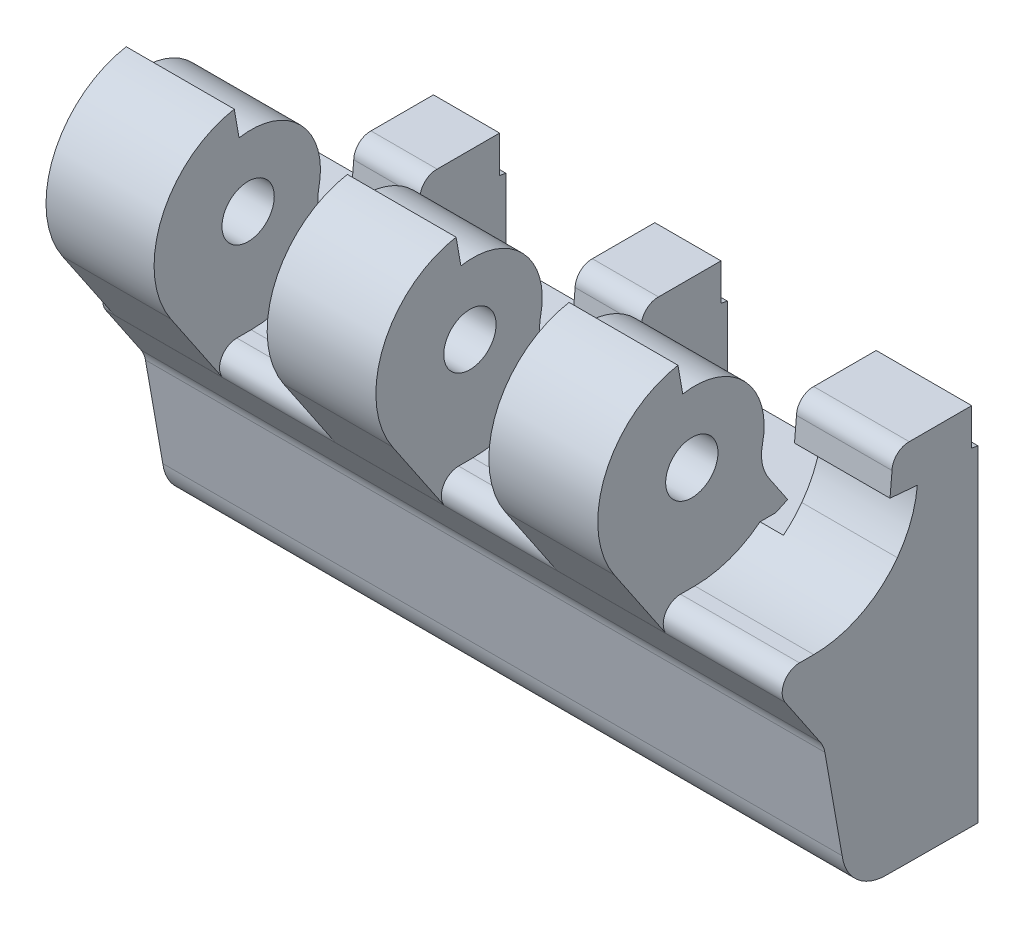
ISO-10303-21;
HEADER;
FILE_DESCRIPTION(('STEP AP214'),'2;1');
FILE_NAME('part.step','',(''),(''),'','','');
FILE_SCHEMA(('AUTOMOTIVE_DESIGN { 1 0 10303 214 1 1 1 1 }'));
ENDSEC;
DATA;
#1=APPLICATION_CONTEXT('core data for automotive mechanical design processes');
#2=APPLICATION_PROTOCOL_DEFINITION('international standard','automotive_design',2000,#1);
#3=PRODUCT_CONTEXT('',#1,'mechanical');
#4=PRODUCT('Part','Part','',(#3));
#5=PRODUCT_RELATED_PRODUCT_CATEGORY('part','',(#4));
#6=PRODUCT_DEFINITION_FORMATION('','',#4);
#7=PRODUCT_DEFINITION_CONTEXT('part definition',#1,'design');
#8=PRODUCT_DEFINITION('design','',#6,#7);
#9=PRODUCT_DEFINITION_SHAPE('','',#8);
#10=(LENGTH_UNIT() NAMED_UNIT(*) SI_UNIT(.MILLI.,.METRE.));
#11=(NAMED_UNIT(*) PLANE_ANGLE_UNIT() SI_UNIT($,.RADIAN.));
#12=(NAMED_UNIT(*) SI_UNIT($,.STERADIAN.) SOLID_ANGLE_UNIT());
#13=UNCERTAINTY_MEASURE_WITH_UNIT(LENGTH_MEASURE(1.E-05),#10,'distance_accuracy_value','');
#14=(GEOMETRIC_REPRESENTATION_CONTEXT(3) GLOBAL_UNCERTAINTY_ASSIGNED_CONTEXT((#13)) GLOBAL_UNIT_ASSIGNED_CONTEXT((#10,
#11,#12)) REPRESENTATION_CONTEXT('',''));
#15=CARTESIAN_POINT('',(0.,0.,0.));
#16=DIRECTION('',(0.,0.,1.));
#17=DIRECTION('',(1.,0.,0.));
#18=AXIS2_PLACEMENT_3D('',#15,#16,#17);
#19=CARTESIAN_POINT('',(-11.67,17.6979546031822,5.35403256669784));
#20=DIRECTION('',(-1.,0.,0.));
#21=DIRECTION('',(0.,-1.,0.));
#22=AXIS2_PLACEMENT_3D('',#19,#20,#21);
#23=CYLINDRICAL_SURFACE('',#22,3.97949973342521);
#24=DIRECTION('',(1.,0.,0.));
#25=VECTOR('',#24,1.);
#26=CARTESIAN_POINT('',(-11.67,15.4699793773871,8.65138673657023));
#27=LINE('',#26,#25);
#28=CARTESIAN_POINT('',(-11.67,15.4699794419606,8.65138678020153));
#29=VERTEX_POINT('',#28);
#30=CARTESIAN_POINT('',(-1.33,15.4699794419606,8.65138678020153));
#31=VERTEX_POINT('',#30);
#32=EDGE_CURVE('E462',#29,#31,#27,.T.);
#33=ORIENTED_EDGE('',*,*,#32,.F.);
#34=CARTESIAN_POINT('',(-11.67,17.6979546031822,5.35403256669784));
#35=DIRECTION('',(-1.,0.,0.));
#36=DIRECTION('',(0.,-1.,0.));
#37=AXIS2_PLACEMENT_3D('',#34,#35,#36);
#38=CIRCLE('',#37,3.97949973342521);
#39=CARTESIAN_POINT('',(-11.67,18.5614666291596,9.23871596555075));
#40=VERTEX_POINT('',#39);
#41=EDGE_CURVE('E447',#29,#40,#38,.T.);
#42=ORIENTED_EDGE('',*,*,#41,.T.);
#43=DIRECTION('',(-1.,0.,0.));
#44=VECTOR('',#43,1.);
#45=CARTESIAN_POINT('',(-11.67,18.5614666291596,9.23871596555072));
#46=LINE('',#45,#44);
#47=CARTESIAN_POINT('',(-1.33,18.5614666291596,9.23871596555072));
#48=VERTEX_POINT('',#47);
#49=EDGE_CURVE('E719',#48,#40,#46,.T.);
#50=ORIENTED_EDGE('',*,*,#49,.F.);
#51=CARTESIAN_POINT('',(-1.33,17.6979546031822,5.35403256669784));
#52=DIRECTION('',(-1.,0.,0.));
#53=DIRECTION('',(0.,-1.,0.));
#54=AXIS2_PLACEMENT_3D('',#51,#52,#53);
#55=CIRCLE('',#54,3.97949973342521);
#56=EDGE_CURVE('E464',#31,#48,#55,.T.);
#57=ORIENTED_EDGE('',*,*,#56,.F.);
#58=EDGE_LOOP('',(#33,#42,#50,#57));
#59=FACE_BOUND('',#58,.T.);
#60=ADVANCED_FACE('F15',(#59),#23,.F.);
#61=CARTESIAN_POINT('',(-11.67,20.0002680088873,15.7132743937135));
#62=DIRECTION('',(-1.,0.,0.));
#63=DIRECTION('',(0.,-1.,0.));
#64=AXIS2_PLACEMENT_3D('',#61,#62,#63);
#65=CYLINDRICAL_SURFACE('',#64,6.6325);
#66=CARTESIAN_POINT('',(-11.67,20.0002680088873,15.7132743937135));
#67=DIRECTION('',(-1.,0.,0.));
#68=DIRECTION('',(0.,-1.,0.));
#69=AXIS2_PLACEMENT_3D('',#66,#67,#68);
#70=CIRCLE('',#69,6.6325);
#71=CARTESIAN_POINT('',(-11.67,26.5319666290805,16.8652159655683));
#72=VERTEX_POINT('',#71);
#73=EDGE_CURVE('E456',#40,#72,#70,.F.);
#74=ORIENTED_EDGE('',*,*,#73,.T.);
#75=DIRECTION('',(1.,0.,0.));
#76=VECTOR('',#75,1.);
#77=CARTESIAN_POINT('',(-11.67,26.5319666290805,16.8652159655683));
#78=LINE('',#77,#76);
#79=CARTESIAN_POINT('',(-1.33,26.5319666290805,16.8652159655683));
#80=VERTEX_POINT('',#79);
#81=EDGE_CURVE('E1202',#80,#72,#78,.F.);
#82=ORIENTED_EDGE('',*,*,#81,.F.);
#83=CARTESIAN_POINT('',(-1.33,20.0002680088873,15.7132743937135));
#84=DIRECTION('',(-1.,0.,0.));
#85=DIRECTION('',(0.,-1.,0.));
#86=AXIS2_PLACEMENT_3D('',#83,#84,#85);
#87=CIRCLE('',#86,6.6325);
#88=EDGE_CURVE('E666',#48,#80,#87,.F.);
#89=ORIENTED_EDGE('',*,*,#88,.F.);
#90=ORIENTED_EDGE('',*,*,#49,.T.);
#91=EDGE_LOOP('',(#74,#82,#89,#90));
#92=FACE_BOUND('',#91,.T.);
#93=ADVANCED_FACE('F2032',(#92),#65,.T.);
#94=CARTESIAN_POINT('',(-11.67,29.1444666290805,17.3262159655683));
#95=DIRECTION('',(0.,0.17377458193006,-0.98478545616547));
#96=DIRECTION('',(0.,0.98478545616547,0.17377458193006));
#97=AXIS2_PLACEMENT_3D('',#94,#95,#96);
#98=PLANE('',#97);
#99=DIRECTION('',(0.,0.98478545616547,0.173774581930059));
#100=VECTOR('',#99,1.);
#101=CARTESIAN_POINT('',(-11.67,26.5319666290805,16.8652159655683));
#102=LINE('',#101,#100);
#103=CARTESIAN_POINT('',(-11.67,29.1444666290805,17.3262159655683));
#104=VERTEX_POINT('',#103);
#105=EDGE_CURVE('E685',#72,#104,#102,.T.);
#106=ORIENTED_EDGE('',*,*,#105,.T.);
#107=DIRECTION('',(-1.,0.,0.));
#108=VECTOR('',#107,1.);
#109=CARTESIAN_POINT('',(-11.67,29.1444666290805,17.3262159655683));
#110=LINE('',#109,#108);
#111=CARTESIAN_POINT('',(-1.33,29.1444666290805,17.3262159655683));
#112=VERTEX_POINT('',#111);
#113=EDGE_CURVE('E1179',#112,#104,#110,.T.);
#114=ORIENTED_EDGE('',*,*,#113,.F.);
#115=DIRECTION('',(0.,0.98478545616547,0.173774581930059));
#116=VECTOR('',#115,1.);
#117=CARTESIAN_POINT('',(-1.33,26.5319666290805,16.8652159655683));
#118=LINE('',#117,#116);
#119=EDGE_CURVE('E665',#80,#112,#118,.T.);
#120=ORIENTED_EDGE('',*,*,#119,.F.);
#121=ORIENTED_EDGE('',*,*,#81,.T.);
#122=EDGE_LOOP('',(#106,#114,#120,#121));
#123=FACE_BOUND('',#122,.T.);
#124=ADVANCED_FACE('F2022',(#123),#98,.T.);
#125=CARTESIAN_POINT('',(-11.67,20.0000000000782,15.7140000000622));
#126=DIRECTION('',(-1.,0.,0.));
#127=DIRECTION('',(0.,-1.,0.));
#128=AXIS2_PLACEMENT_3D('',#125,#126,#127);
#129=CYLINDRICAL_SURFACE('',#128,9.28549999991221);
#130=CARTESIAN_POINT('',(-11.67,20.0000000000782,15.7140000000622));
#131=DIRECTION('',(-1.,0.,0.));
#132=DIRECTION('',(0.,-1.,0.));
#133=AXIS2_PLACEMENT_3D('',#130,#131,#132);
#134=CIRCLE('',#133,9.28549999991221);
#135=CARTESIAN_POINT('',(-11.67,14.8019985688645,23.4082375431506));
#136=VERTEX_POINT('',#135);
#137=EDGE_CURVE('E682',#104,#136,#134,.F.);
#138=ORIENTED_EDGE('',*,*,#137,.T.);
#139=DIRECTION('',(1.,0.,0.));
#140=VECTOR('',#139,1.);
#141=CARTESIAN_POINT('',(-11.67,14.8019985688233,23.4082375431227));
#142=LINE('',#141,#140);
#143=CARTESIAN_POINT('',(-1.33,14.8019985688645,23.4082375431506));
#144=VERTEX_POINT('',#143);
#145=EDGE_CURVE('E1138',#144,#136,#142,.F.);
#146=ORIENTED_EDGE('',*,*,#145,.F.);
#147=CARTESIAN_POINT('',(-1.33,20.0000000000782,15.7140000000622));
#148=DIRECTION('',(-1.,0.,0.));
#149=DIRECTION('',(0.,-1.,0.));
#150=AXIS2_PLACEMENT_3D('',#147,#148,#149);
#151=CIRCLE('',#150,9.28549999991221);
#152=EDGE_CURVE('E661',#112,#144,#151,.F.);
#153=ORIENTED_EDGE('',*,*,#152,.F.);
#154=ORIENTED_EDGE('',*,*,#113,.T.);
#155=EDGE_LOOP('',(#138,#146,#153,#154));
#156=FACE_BOUND('',#155,.T.);
#157=ADVANCED_FACE('F2013',(#156),#129,.T.);
#158=CARTESIAN_POINT('',(19.89,17.6979546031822,5.35403256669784));
#159=DIRECTION('',(1.,0.,0.));
#160=DIRECTION('',(0.,1.,0.));
#161=AXIS2_PLACEMENT_3D('',#158,#159,#160);
#162=CYLINDRICAL_SURFACE('',#161,3.97949973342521);
#163=DIRECTION('',(1.,0.,0.));
#164=VECTOR('',#163,1.);
#165=CARTESIAN_POINT('',(19.89,18.5614666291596,9.23871596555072));
#166=LINE('',#165,#164);
#167=CARTESIAN_POINT('',(19.89,18.5614666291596,9.23871596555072));
#168=VERTEX_POINT('',#167);
#169=CARTESIAN_POINT('',(9.49,18.5614666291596,9.23871596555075));
#170=VERTEX_POINT('',#169);
#171=EDGE_CURVE('E1176',#168,#170,#166,.F.);
#172=ORIENTED_EDGE('',*,*,#171,.F.);
#173=CARTESIAN_POINT('',(19.89,17.6979546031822,5.35403256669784));
#174=DIRECTION('',(1.,0.,0.));
#175=DIRECTION('',(0.,1.,0.));
#176=AXIS2_PLACEMENT_3D('',#173,#174,#175);
#177=CIRCLE('',#176,3.97949973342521);
#178=CARTESIAN_POINT('',(19.89,15.4699794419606,8.65138678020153));
#179=VERTEX_POINT('',#178);
#180=EDGE_CURVE('E648',#179,#168,#177,.F.);
#181=ORIENTED_EDGE('',*,*,#180,.F.);
#182=DIRECTION('',(1.,0.,0.));
#183=VECTOR('',#182,1.);
#184=CARTESIAN_POINT('',(19.89,15.4699793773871,8.65138673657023));
#185=LINE('',#184,#183);
#186=CARTESIAN_POINT('',(9.49,15.4699794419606,8.65138678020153));
#187=VERTEX_POINT('',#186);
#188=EDGE_CURVE('E467',#187,#179,#185,.T.);
#189=ORIENTED_EDGE('',*,*,#188,.F.);
#190=CARTESIAN_POINT('',(9.49,17.6979546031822,5.35403256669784));
#191=DIRECTION('',(1.,0.,0.));
#192=DIRECTION('',(0.,1.,0.));
#193=AXIS2_PLACEMENT_3D('',#190,#191,#192);
#194=CIRCLE('',#193,3.97949973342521);
#195=EDGE_CURVE('E677',#187,#170,#194,.F.);
#196=ORIENTED_EDGE('',*,*,#195,.T.);
#197=EDGE_LOOP('',(#172,#181,#189,#196));
#198=FACE_BOUND('',#197,.T.);
#199=ADVANCED_FACE('F1296',(#198),#162,.F.);
#200=CARTESIAN_POINT('',(19.89,20.0002680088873,15.7132743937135));
#201=DIRECTION('',(1.,0.,0.));
#202=DIRECTION('',(0.,1.,0.));
#203=AXIS2_PLACEMENT_3D('',#200,#201,#202);
#204=CYLINDRICAL_SURFACE('',#203,6.6325);
#205=CARTESIAN_POINT('',(19.89,20.0002680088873,15.7132743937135));
#206=DIRECTION('',(1.,0.,0.));
#207=DIRECTION('',(0.,1.,0.));
#208=AXIS2_PLACEMENT_3D('',#205,#206,#207);
#209=CIRCLE('',#208,6.6325);
#210=CARTESIAN_POINT('',(19.89,26.5319666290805,16.8652159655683));
#211=VERTEX_POINT('',#210);
#212=EDGE_CURVE('E645',#168,#211,#209,.T.);
#213=ORIENTED_EDGE('',*,*,#212,.F.);
#214=ORIENTED_EDGE('',*,*,#171,.T.);
#215=CARTESIAN_POINT('',(9.49,20.0002680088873,15.7132743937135));
#216=DIRECTION('',(1.,0.,0.));
#217=DIRECTION('',(0.,1.,0.));
#218=AXIS2_PLACEMENT_3D('',#215,#216,#217);
#219=CIRCLE('',#218,6.6325);
#220=CARTESIAN_POINT('',(9.49,26.5319666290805,16.8652159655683));
#221=VERTEX_POINT('',#220);
#222=EDGE_CURVE('E675',#170,#221,#219,.T.);
#223=ORIENTED_EDGE('',*,*,#222,.T.);
#224=DIRECTION('',(1.,0.,0.));
#225=VECTOR('',#224,1.);
#226=CARTESIAN_POINT('',(19.89,26.5319666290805,16.8652159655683));
#227=LINE('',#226,#225);
#228=EDGE_CURVE('E1173',#211,#221,#227,.F.);
#229=ORIENTED_EDGE('',*,*,#228,.F.);
#230=EDGE_LOOP('',(#213,#214,#223,#229));
#231=FACE_BOUND('',#230,.T.);
#232=ADVANCED_FACE('F1294',(#231),#204,.T.);
#233=CARTESIAN_POINT('',(19.89,26.5319666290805,16.8652159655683));
#234=DIRECTION('',(0.,0.17377458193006,-0.98478545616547));
#235=DIRECTION('',(0.,0.98478545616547,0.17377458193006));
#236=AXIS2_PLACEMENT_3D('',#233,#234,#235);
#237=PLANE('',#236);
#238=DIRECTION('',(0.,0.98478545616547,0.173774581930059));
#239=VECTOR('',#238,1.);
#240=CARTESIAN_POINT('',(19.89,26.5319666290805,16.8652159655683));
#241=LINE('',#240,#239);
#242=CARTESIAN_POINT('',(19.89,29.1444666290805,17.3262159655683));
#243=VERTEX_POINT('',#242);
#244=EDGE_CURVE('E644',#211,#243,#241,.T.);
#245=ORIENTED_EDGE('',*,*,#244,.F.);
#246=ORIENTED_EDGE('',*,*,#228,.T.);
#247=DIRECTION('',(0.,0.98478545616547,0.173774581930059));
#248=VECTOR('',#247,1.);
#249=CARTESIAN_POINT('',(9.49,26.5319666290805,16.8652159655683));
#250=LINE('',#249,#248);
#251=CARTESIAN_POINT('',(9.49,29.1444666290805,17.3262159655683));
#252=VERTEX_POINT('',#251);
#253=EDGE_CURVE('E674',#221,#252,#250,.T.);
#254=ORIENTED_EDGE('',*,*,#253,.T.);
#255=DIRECTION('',(1.,0.,0.));
#256=VECTOR('',#255,1.);
#257=CARTESIAN_POINT('',(19.89,29.1444666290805,17.3262159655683));
#258=LINE('',#257,#256);
#259=EDGE_CURVE('E1154',#243,#252,#258,.F.);
#260=ORIENTED_EDGE('',*,*,#259,.F.);
#261=EDGE_LOOP('',(#245,#246,#254,#260));
#262=FACE_BOUND('',#261,.T.);
#263=ADVANCED_FACE('F1291',(#262),#237,.T.);
#264=CARTESIAN_POINT('',(19.89,20.0000000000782,15.7140000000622));
#265=DIRECTION('',(1.,0.,0.));
#266=DIRECTION('',(0.,1.,0.));
#267=AXIS2_PLACEMENT_3D('',#264,#265,#266);
#268=CYLINDRICAL_SURFACE('',#267,9.28549999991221);
#269=CARTESIAN_POINT('',(19.89,20.0000000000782,15.7140000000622));
#270=DIRECTION('',(1.,0.,0.));
#271=DIRECTION('',(0.,1.,0.));
#272=AXIS2_PLACEMENT_3D('',#269,#270,#271);
#273=CIRCLE('',#272,9.28549999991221);
#274=CARTESIAN_POINT('',(19.89,14.8019985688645,23.4082375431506));
#275=VERTEX_POINT('',#274);
#276=EDGE_CURVE('E640',#243,#275,#273,.T.);
#277=ORIENTED_EDGE('',*,*,#276,.F.);
#278=ORIENTED_EDGE('',*,*,#259,.T.);
#279=CARTESIAN_POINT('',(9.49,20.0000000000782,15.7140000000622));
#280=DIRECTION('',(1.,0.,0.));
#281=DIRECTION('',(0.,1.,0.));
#282=AXIS2_PLACEMENT_3D('',#279,#280,#281);
#283=CIRCLE('',#282,9.28549999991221);
#284=CARTESIAN_POINT('',(9.49,14.8019985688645,23.4082375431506));
#285=VERTEX_POINT('',#284);
#286=EDGE_CURVE('E671',#252,#285,#283,.T.);
#287=ORIENTED_EDGE('',*,*,#286,.T.);
#288=DIRECTION('',(1.,0.,0.));
#289=VECTOR('',#288,1.);
#290=CARTESIAN_POINT('',(19.89,14.8019985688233,23.4082375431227));
#291=LINE('',#290,#289);
#292=EDGE_CURVE('E681',#275,#285,#291,.F.);
#293=ORIENTED_EDGE('',*,*,#292,.F.);
#294=EDGE_LOOP('',(#277,#278,#287,#293));
#295=FACE_BOUND('',#294,.T.);
#296=ADVANCED_FACE('F1287',(#295),#268,.T.);
#297=CARTESIAN_POINT('',(41.12,17.6979546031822,5.35403256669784));
#298=DIRECTION('',(1.,0.,0.));
#299=DIRECTION('',(0.,1.,0.));
#300=AXIS2_PLACEMENT_3D('',#297,#298,#299);
#301=CYLINDRICAL_SURFACE('',#300,3.97949973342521);
#302=DIRECTION('',(1.,0.,0.));
#303=VECTOR('',#302,1.);
#304=CARTESIAN_POINT('',(41.12,18.5614666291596,9.23871596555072));
#305=LINE('',#304,#303);
#306=CARTESIAN_POINT('',(41.12,18.5614666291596,9.23871596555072));
#307=VERTEX_POINT('',#306);
#308=CARTESIAN_POINT('',(30.7,18.5614666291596,9.23871596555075));
#309=VERTEX_POINT('',#308);
#310=EDGE_CURVE('E1151',#307,#309,#305,.F.);
#311=ORIENTED_EDGE('',*,*,#310,.F.);
#312=CARTESIAN_POINT('',(41.12,17.6979546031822,5.35403256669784));
#313=DIRECTION('',(1.,0.,0.));
#314=DIRECTION('',(0.,1.,0.));
#315=AXIS2_PLACEMENT_3D('',#312,#313,#314);
#316=CIRCLE('',#315,3.97949973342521);
#317=CARTESIAN_POINT('',(41.12,15.4699794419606,8.65138678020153));
#318=VERTEX_POINT('',#317);
#319=EDGE_CURVE('E636',#318,#307,#316,.F.);
#320=ORIENTED_EDGE('',*,*,#319,.F.);
#321=DIRECTION('',(1.,0.,0.));
#322=VECTOR('',#321,1.);
#323=CARTESIAN_POINT('',(41.12,15.4699793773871,8.65138673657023));
#324=LINE('',#323,#322);
#325=CARTESIAN_POINT('',(30.7,15.4699794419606,8.65138678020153));
#326=VERTEX_POINT('',#325);
#327=EDGE_CURVE('E1094',#326,#318,#324,.T.);
#328=ORIENTED_EDGE('',*,*,#327,.F.);
#329=CARTESIAN_POINT('',(30.7,17.6979546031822,5.35403256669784));
#330=DIRECTION('',(1.,0.,0.));
#331=DIRECTION('',(0.,1.,0.));
#332=AXIS2_PLACEMENT_3D('',#329,#330,#331);
#333=CIRCLE('',#332,3.97949973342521);
#334=EDGE_CURVE('E658',#326,#309,#333,.F.);
#335=ORIENTED_EDGE('',*,*,#334,.T.);
#336=EDGE_LOOP('',(#311,#320,#328,#335));
#337=FACE_BOUND('',#336,.T.);
#338=ADVANCED_FACE('F1970',(#337),#301,.F.);
#339=CARTESIAN_POINT('',(41.12,20.0002680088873,15.7132743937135));
#340=DIRECTION('',(1.,0.,0.));
#341=DIRECTION('',(0.,1.,0.));
#342=AXIS2_PLACEMENT_3D('',#339,#340,#341);
#343=CYLINDRICAL_SURFACE('',#342,6.6325);
#344=CARTESIAN_POINT('',(41.12,20.0002680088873,15.7132743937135));
#345=DIRECTION('',(1.,0.,0.));
#346=DIRECTION('',(0.,1.,0.));
#347=AXIS2_PLACEMENT_3D('',#344,#345,#346);
#348=CIRCLE('',#347,6.6325);
#349=CARTESIAN_POINT('',(41.12,26.5319666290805,16.8652159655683));
#350=VERTEX_POINT('',#349);
#351=EDGE_CURVE('E633',#307,#350,#348,.T.);
#352=ORIENTED_EDGE('',*,*,#351,.F.);
#353=ORIENTED_EDGE('',*,*,#310,.T.);
#354=CARTESIAN_POINT('',(30.7,20.0002680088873,15.7132743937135));
#355=DIRECTION('',(1.,0.,0.));
#356=DIRECTION('',(0.,1.,0.));
#357=AXIS2_PLACEMENT_3D('',#354,#355,#356);
#358=CIRCLE('',#357,6.6325);
#359=CARTESIAN_POINT('',(30.7,26.5319666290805,16.8652159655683));
#360=VERTEX_POINT('',#359);
#361=EDGE_CURVE('E656',#309,#360,#358,.T.);
#362=ORIENTED_EDGE('',*,*,#361,.T.);
#363=DIRECTION('',(1.,0.,0.));
#364=VECTOR('',#363,1.);
#365=CARTESIAN_POINT('',(41.12,26.5319666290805,16.8652159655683));
#366=LINE('',#365,#364);
#367=EDGE_CURVE('E1148',#350,#360,#366,.F.);
#368=ORIENTED_EDGE('',*,*,#367,.F.);
#369=EDGE_LOOP('',(#352,#353,#362,#368));
#370=FACE_BOUND('',#369,.T.);
#371=ADVANCED_FACE('F1960',(#370),#343,.T.);
#372=CARTESIAN_POINT('',(41.12,26.5319666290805,16.8652159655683));
#373=DIRECTION('',(0.,0.17377458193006,-0.98478545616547));
#374=DIRECTION('',(0.,0.98478545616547,0.17377458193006));
#375=AXIS2_PLACEMENT_3D('',#372,#373,#374);
#376=PLANE('',#375);
#377=DIRECTION('',(0.,0.98478545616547,0.173774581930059));
#378=VECTOR('',#377,1.);
#379=CARTESIAN_POINT('',(41.12,26.5319666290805,16.8652159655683));
#380=LINE('',#379,#378);
#381=CARTESIAN_POINT('',(41.12,29.1444666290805,17.3262159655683));
#382=VERTEX_POINT('',#381);
#383=EDGE_CURVE('E632',#350,#382,#380,.T.);
#384=ORIENTED_EDGE('',*,*,#383,.F.);
#385=ORIENTED_EDGE('',*,*,#367,.T.);
#386=DIRECTION('',(0.,0.98478545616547,0.173774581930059));
#387=VECTOR('',#386,1.);
#388=CARTESIAN_POINT('',(30.7,26.5319666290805,16.8652159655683));
#389=LINE('',#388,#387);
#390=CARTESIAN_POINT('',(30.7,29.1444666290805,17.3262159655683));
#391=VERTEX_POINT('',#390);
#392=EDGE_CURVE('E655',#360,#391,#389,.T.);
#393=ORIENTED_EDGE('',*,*,#392,.T.);
#394=DIRECTION('',(1.,0.,0.));
#395=VECTOR('',#394,1.);
#396=CARTESIAN_POINT('',(41.12,29.1444666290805,17.3262159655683));
#397=LINE('',#396,#395);
#398=EDGE_CURVE('E1145',#382,#391,#397,.F.);
#399=ORIENTED_EDGE('',*,*,#398,.F.);
#400=EDGE_LOOP('',(#384,#385,#393,#399));
#401=FACE_BOUND('',#400,.T.);
#402=ADVANCED_FACE('F1950',(#401),#376,.T.);
#403=CARTESIAN_POINT('',(41.12,20.0000000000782,15.7140000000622));
#404=DIRECTION('',(1.,0.,0.));
#405=DIRECTION('',(0.,1.,0.));
#406=AXIS2_PLACEMENT_3D('',#403,#404,#405);
#407=CYLINDRICAL_SURFACE('',#406,9.28549999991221);
#408=CARTESIAN_POINT('',(41.12,20.0000000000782,15.7140000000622));
#409=DIRECTION('',(1.,0.,0.));
#410=DIRECTION('',(0.,1.,0.));
#411=AXIS2_PLACEMENT_3D('',#408,#409,#410);
#412=CIRCLE('',#411,9.28549999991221);
#413=CARTESIAN_POINT('',(41.12,14.8019985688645,23.4082375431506));
#414=VERTEX_POINT('',#413);
#415=EDGE_CURVE('E628',#382,#414,#412,.T.);
#416=ORIENTED_EDGE('',*,*,#415,.F.);
#417=ORIENTED_EDGE('',*,*,#398,.T.);
#418=CARTESIAN_POINT('',(30.7,20.0000000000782,15.7140000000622));
#419=DIRECTION('',(1.,0.,0.));
#420=DIRECTION('',(0.,1.,0.));
#421=AXIS2_PLACEMENT_3D('',#418,#419,#420);
#422=CIRCLE('',#421,9.28549999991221);
#423=CARTESIAN_POINT('',(30.7,14.8019985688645,23.4082375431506));
#424=VERTEX_POINT('',#423);
#425=EDGE_CURVE('E652',#391,#424,#422,.T.);
#426=ORIENTED_EDGE('',*,*,#425,.T.);
#427=DIRECTION('',(1.,0.,0.));
#428=VECTOR('',#427,1.);
#429=CARTESIAN_POINT('',(41.12,14.8019985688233,23.4082375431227));
#430=LINE('',#429,#428);
#431=EDGE_CURVE('E1135',#414,#424,#430,.F.);
#432=ORIENTED_EDGE('',*,*,#431,.F.);
#433=EDGE_LOOP('',(#416,#417,#426,#432));
#434=FACE_BOUND('',#433,.T.);
#435=ADVANCED_FACE('F1940',(#434),#407,.T.);
#436=CARTESIAN_POINT('',(-11.67,7.4644666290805,18.4512159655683));
#437=DIRECTION('',(0.,-0.559797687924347,0.828629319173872));
#438=DIRECTION('',(0.,-0.828629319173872,-0.559797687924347));
#439=AXIS2_PLACEMENT_3D('',#436,#437,#438);
#440=PLANE('',#439);
#441=ORIENTED_EDGE('',*,*,#145,.T.);
#442=DIRECTION('',(0.,-0.82862931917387,-0.559797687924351));
#443=VECTOR('',#442,1.);
#444=CARTESIAN_POINT('',(-11.67,14.8019985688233,23.4082375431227));
#445=LINE('',#444,#443);
#446=CARTESIAN_POINT('',(-11.67,7.48718669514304,18.4665649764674));
#447=VERTEX_POINT('',#446);
#448=EDGE_CURVE('E684',#136,#447,#445,.T.);
#449=ORIENTED_EDGE('',*,*,#448,.T.);
#450=DIRECTION('',(1.,0.,0.));
#451=VECTOR('',#450,1.);
#452=CARTESIAN_POINT('',(52.5,7.4871866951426,18.4665649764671));
#453=LINE('',#452,#451);
#454=CARTESIAN_POINT('',(-1.33,7.48718669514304,18.4665649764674));
#455=VERTEX_POINT('',#454);
#456=EDGE_CURVE('E619',#455,#447,#453,.F.);
#457=ORIENTED_EDGE('',*,*,#456,.F.);
#458=DIRECTION('',(0.,-0.82862931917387,-0.559797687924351));
#459=VECTOR('',#458,1.);
#460=CARTESIAN_POINT('',(-1.33,14.8019985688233,23.4082375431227));
#461=LINE('',#460,#459);
#462=EDGE_CURVE('E664',#144,#455,#461,.T.);
#463=ORIENTED_EDGE('',*,*,#462,.F.);
#464=EDGE_LOOP('',(#441,#449,#457,#463));
#465=FACE_BOUND('',#464,.T.);
#466=ADVANCED_FACE('F1732',(#465),#440,.T.);
#467=CARTESIAN_POINT('',(-11.67,20.,0.));
#468=DIRECTION('',(1.,0.,0.));
#469=DIRECTION('',(0.,1.,0.));
#470=AXIS2_PLACEMENT_3D('',#467,#468,#469);
#471=PLANE('',#470);
#472=CARTESIAN_POINT('',(-11.67,20.,16.));
#473=DIRECTION('',(-1.,0.,0.));
#474=DIRECTION('',(0.,0.,1.));
#475=AXIS2_PLACEMENT_3D('',#472,#473,#474);
#476=CIRCLE('',#475,2.5);
#477=CARTESIAN_POINT('',(-11.67,20.,18.5));
#478=VERTEX_POINT('',#477);
#479=EDGE_CURVE('E2149',#478,#478,#476,.T.);
#480=ORIENTED_EDGE('',*,*,#479,.F.);
#481=EDGE_LOOP('',(#480));
#482=FACE_BOUND('',#481,.T.);
#483=ORIENTED_EDGE('',*,*,#448,.F.);
#484=ORIENTED_EDGE('',*,*,#137,.F.);
#485=ORIENTED_EDGE('',*,*,#105,.F.);
#486=ORIENTED_EDGE('',*,*,#73,.F.);
#487=ORIENTED_EDGE('',*,*,#41,.F.);
#488=DIRECTION('',(0.,0.828585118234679,0.55986310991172));
#489=VECTOR('',#488,1.);
#490=CARTESIAN_POINT('',(-11.67,15.4699793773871,8.65138673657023));
#491=LINE('',#490,#489);
#492=CARTESIAN_POINT('',(-11.67,12.7724666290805,6.82871596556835));
#493=VERTEX_POINT('',#492);
#494=EDGE_CURVE('E453',#493,#29,#491,.T.);
#495=ORIENTED_EDGE('',*,*,#494,.F.);
#496=DIRECTION('',(0.,0.415426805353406,-0.909626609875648));
#497=VECTOR('',#496,1.);
#498=CARTESIAN_POINT('',(-11.67,12.25,7.97271905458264));
#499=LINE('',#498,#497);
#500=CARTESIAN_POINT('',(-11.67,12.25,7.97271905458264));
#501=VERTEX_POINT('',#500);
#502=EDGE_CURVE('E459',#501,#493,#499,.T.);
#503=ORIENTED_EDGE('',*,*,#502,.F.);
#504=DIRECTION('',(0.,0.,1.));
#505=VECTOR('',#504,1.);
#506=CARTESIAN_POINT('',(-11.67,12.25,0.));
#507=LINE('',#506,#505);
#508=CARTESIAN_POINT('',(-11.67,12.25,9.47537381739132));
#509=VERTEX_POINT('',#508);
#510=EDGE_CURVE('E483',#509,#501,#507,.F.);
#511=ORIENTED_EDGE('',*,*,#510,.F.);
#512=CARTESIAN_POINT('',(-11.67,19.9999999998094,15.7139714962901));
#513=DIRECTION('',(1.,0.,0.));
#514=DIRECTION('',(0.,1.,0.));
#515=AXIS2_PLACEMENT_3D('',#512,#513,#514);
#516=CIRCLE('',#515,9.94899999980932);
#517=CARTESIAN_POINT('',(-11.67,10.051,15.7139714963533));
#518=VERTEX_POINT('',#517);
#519=EDGE_CURVE('E624',#509,#518,#516,.F.);
#520=ORIENTED_EDGE('',*,*,#519,.T.);
#521=DIRECTION('',(0.,0.,1.));
#522=VECTOR('',#521,1.);
#523=CARTESIAN_POINT('',(-11.67,10.051,15.7139714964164));
#524=LINE('',#523,#522);
#525=CARTESIAN_POINT('',(-11.67,10.051,17.0778728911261));
#526=VERTEX_POINT('',#525);
#527=EDGE_CURVE('E626',#526,#518,#524,.F.);
#528=ORIENTED_EDGE('',*,*,#527,.F.);
#529=CARTESIAN_POINT('',(-11.67,8.3930001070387,17.0778728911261));
#530=DIRECTION('',(1.,0.,0.));
#531=DIRECTION('',(0.,1.,0.));
#532=AXIS2_PLACEMENT_3D('',#529,#530,#531);
#533=CIRCLE('',#532,1.65799989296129);
#534=EDGE_CURVE('E615',#447,#526,#533,.F.);
#535=ORIENTED_EDGE('',*,*,#534,.F.);
#536=EDGE_LOOP('',(#483,#484,#485,#486,#487,#495,#503,#511,#520,#528,#535));
#537=FACE_BOUND('',#536,.T.);
#538=ADVANCED_FACE('F450',(#482,#537),#471,.F.);
#539=CARTESIAN_POINT('',(41.12,14.8019985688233,23.4082375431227));
#540=DIRECTION('',(0.,-0.559797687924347,0.828629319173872));
#541=DIRECTION('',(0.,-0.828629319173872,-0.559797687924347));
#542=AXIS2_PLACEMENT_3D('',#539,#540,#541);
#543=PLANE('',#542);
#544=ORIENTED_EDGE('',*,*,#431,.T.);
#545=DIRECTION('',(0.,-0.82862931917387,-0.559797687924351));
#546=VECTOR('',#545,1.);
#547=CARTESIAN_POINT('',(30.7,14.8019985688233,23.4082375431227));
#548=LINE('',#547,#546);
#549=CARTESIAN_POINT('',(30.7,7.48718669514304,18.4665649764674));
#550=VERTEX_POINT('',#549);
#551=EDGE_CURVE('E654',#424,#550,#548,.T.);
#552=ORIENTED_EDGE('',*,*,#551,.T.);
#553=DIRECTION('',(1.,0.,0.));
#554=VECTOR('',#553,1.);
#555=CARTESIAN_POINT('',(52.5,7.4871866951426,18.4665649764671));
#556=LINE('',#555,#554);
#557=CARTESIAN_POINT('',(41.12,7.48718669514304,18.4665649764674));
#558=VERTEX_POINT('',#557);
#559=EDGE_CURVE('E610',#558,#550,#556,.F.);
#560=ORIENTED_EDGE('',*,*,#559,.F.);
#561=DIRECTION('',(0.,-0.82862931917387,-0.559797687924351));
#562=VECTOR('',#561,1.);
#563=CARTESIAN_POINT('',(41.12,14.8019985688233,23.4082375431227));
#564=LINE('',#563,#562);
#565=EDGE_CURVE('E631',#414,#558,#564,.T.);
#566=ORIENTED_EDGE('',*,*,#565,.F.);
#567=EDGE_LOOP('',(#544,#552,#560,#566));
#568=FACE_BOUND('',#567,.T.);
#569=ADVANCED_FACE('F1731',(#568),#543,.T.);
#570=CARTESIAN_POINT('',(19.89,14.8019985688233,23.4082375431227));
#571=DIRECTION('',(0.,-0.559797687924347,0.828629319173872));
#572=DIRECTION('',(0.,-0.828629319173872,-0.559797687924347));
#573=AXIS2_PLACEMENT_3D('',#570,#571,#572);
#574=PLANE('',#573);
#575=ORIENTED_EDGE('',*,*,#292,.T.);
#576=DIRECTION('',(0.,-0.82862931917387,-0.559797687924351));
#577=VECTOR('',#576,1.);
#578=CARTESIAN_POINT('',(9.49,14.8019985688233,23.4082375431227));
#579=LINE('',#578,#577);
#580=CARTESIAN_POINT('',(9.49,7.48718669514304,18.4665649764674));
#581=VERTEX_POINT('',#580);
#582=EDGE_CURVE('E673',#285,#581,#579,.T.);
#583=ORIENTED_EDGE('',*,*,#582,.T.);
#584=DIRECTION('',(1.,0.,0.));
#585=VECTOR('',#584,1.);
#586=CARTESIAN_POINT('',(52.5,7.4871866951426,18.4665649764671));
#587=LINE('',#586,#585);
#588=CARTESIAN_POINT('',(19.89,7.48718669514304,18.4665649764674));
#589=VERTEX_POINT('',#588);
#590=EDGE_CURVE('E602',#589,#581,#587,.F.);
#591=ORIENTED_EDGE('',*,*,#590,.F.);
#592=DIRECTION('',(0.,-0.82862931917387,-0.559797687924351));
#593=VECTOR('',#592,1.);
#594=CARTESIAN_POINT('',(19.89,14.8019985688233,23.4082375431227));
#595=LINE('',#594,#593);
#596=EDGE_CURVE('E643',#275,#589,#595,.T.);
#597=ORIENTED_EDGE('',*,*,#596,.F.);
#598=EDGE_LOOP('',(#575,#583,#591,#597));
#599=FACE_BOUND('',#598,.T.);
#600=ADVANCED_FACE('F1284',(#599),#574,.T.);
#601=CARTESIAN_POINT('',(52.5,0.971055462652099,17.2666486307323));
#602=DIRECTION('',(1.,0.,0.));
#603=DIRECTION('',(0.,1.,0.));
#604=AXIS2_PLACEMENT_3D('',#601,#602,#603);
#605=CYLINDRICAL_SURFACE('',#604,2.65299880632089);
#606=DIRECTION('',(1.,0.,0.));
#607=VECTOR('',#606,1.);
#608=CARTESIAN_POINT('',(52.5,1.4317433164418,14.6539547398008));
#609=LINE('',#608,#607);
#610=CARTESIAN_POINT('',(52.5,1.4317434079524,14.6539547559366));
#611=VERTEX_POINT('',#610);
#612=CARTESIAN_POINT('',(-12.5,1.4317434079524,14.6539547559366));
#613=VERTEX_POINT('',#612);
#614=EDGE_CURVE('E984',#611,#613,#609,.F.);
#615=ORIENTED_EDGE('',*,*,#614,.F.);
#616=CARTESIAN_POINT('',(52.5,0.971055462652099,17.2666486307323));
#617=DIRECTION('',(1.,0.,0.));
#618=DIRECTION('',(0.,1.,0.));
#619=AXIS2_PLACEMENT_3D('',#616,#617,#618);
#620=CIRCLE('',#619,2.65299880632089);
#621=CARTESIAN_POINT('',(52.5,2.45612040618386,15.0682435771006));
#622=VERTEX_POINT('',#621);
#623=EDGE_CURVE('E474',#622,#611,#620,.F.);
#624=ORIENTED_EDGE('',*,*,#623,.F.);
#625=DIRECTION('',(1.,0.,0.));
#626=VECTOR('',#625,1.);
#627=CARTESIAN_POINT('',(52.5,2.4561205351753,15.0682436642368));
#628=LINE('',#627,#626);
#629=CARTESIAN_POINT('',(-12.5,2.45612040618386,15.0682435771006));
#630=VERTEX_POINT('',#629);
#631=EDGE_CURVE('E990',#630,#622,#628,.T.);
#632=ORIENTED_EDGE('',*,*,#631,.F.);
#633=CARTESIAN_POINT('',(-12.5,0.971055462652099,17.2666486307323));
#634=DIRECTION('',(1.,0.,0.));
#635=DIRECTION('',(0.,1.,0.));
#636=AXIS2_PLACEMENT_3D('',#633,#634,#635);
#637=CIRCLE('',#636,2.65299880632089);
#638=EDGE_CURVE('E472',#613,#630,#637,.T.);
#639=ORIENTED_EDGE('',*,*,#638,.F.);
#640=EDGE_LOOP('',(#615,#624,#632,#639));
#641=FACE_BOUND('',#640,.T.);
#642=ADVANCED_FACE('F1909',(#641),#605,.F.);
#643=CARTESIAN_POINT('',(-11.67,15.4699793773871,8.65138673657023));
#644=DIRECTION('',(0.,0.55986310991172,-0.828585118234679));
#645=DIRECTION('',(0.,0.828585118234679,0.55986310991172));
#646=AXIS2_PLACEMENT_3D('',#643,#644,#645);
#647=PLANE('',#646);
#648=ORIENTED_EDGE('',*,*,#494,.T.);
#649=ORIENTED_EDGE('',*,*,#32,.T.);
#650=DIRECTION('',(0.,0.82858511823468,0.559863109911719));
#651=VECTOR('',#650,1.);
#652=CARTESIAN_POINT('',(-1.33,12.7724666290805,6.82871596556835));
#653=LINE('',#652,#651);
#654=CARTESIAN_POINT('',(-1.33,12.7724666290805,6.82871596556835));
#655=VERTEX_POINT('',#654);
#656=EDGE_CURVE('E670',#655,#31,#653,.T.);
#657=ORIENTED_EDGE('',*,*,#656,.F.);
#658=DIRECTION('',(1.,0.,0.));
#659=VECTOR('',#658,1.);
#660=CARTESIAN_POINT('',(-11.67,12.7724666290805,6.82871596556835));
#661=LINE('',#660,#659);
#662=EDGE_CURVE('E471',#493,#655,#661,.T.);
#663=ORIENTED_EDGE('',*,*,#662,.F.);
#664=EDGE_LOOP('',(#648,#649,#657,#663));
#665=FACE_BOUND('',#664,.T.);
#666=ADVANCED_FACE('F469',(#665),#647,.T.);
#667=CARTESIAN_POINT('',(19.89,12.7724666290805,6.82871596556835));
#668=DIRECTION('',(0.,0.55986310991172,-0.828585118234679));
#669=DIRECTION('',(0.,0.828585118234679,0.55986310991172));
#670=AXIS2_PLACEMENT_3D('',#667,#668,#669);
#671=PLANE('',#670);
#672=DIRECTION('',(0.,0.82858511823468,0.559863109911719));
#673=VECTOR('',#672,1.);
#674=CARTESIAN_POINT('',(19.89,12.7724666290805,6.82871596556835));
#675=LINE('',#674,#673);
#676=CARTESIAN_POINT('',(19.89,12.7724666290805,6.82871596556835));
#677=VERTEX_POINT('',#676);
#678=EDGE_CURVE('E651',#677,#179,#675,.T.);
#679=ORIENTED_EDGE('',*,*,#678,.F.);
#680=DIRECTION('',(1.,0.,0.));
#681=VECTOR('',#680,1.);
#682=CARTESIAN_POINT('',(19.89,12.7724666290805,6.82871596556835));
#683=LINE('',#682,#681);
#684=CARTESIAN_POINT('',(9.49,12.7724666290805,6.82871596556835));
#685=VERTEX_POINT('',#684);
#686=EDGE_CURVE('E1183',#685,#677,#683,.T.);
#687=ORIENTED_EDGE('',*,*,#686,.F.);
#688=DIRECTION('',(0.,0.82858511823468,0.559863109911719));
#689=VECTOR('',#688,1.);
#690=CARTESIAN_POINT('',(9.49,12.7724666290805,6.82871596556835));
#691=LINE('',#690,#689);
#692=EDGE_CURVE('E678',#685,#187,#691,.T.);
#693=ORIENTED_EDGE('',*,*,#692,.T.);
#694=ORIENTED_EDGE('',*,*,#188,.T.);
#695=EDGE_LOOP('',(#679,#687,#693,#694));
#696=FACE_BOUND('',#695,.T.);
#697=ADVANCED_FACE('F1229',(#696),#671,.T.);
#698=CARTESIAN_POINT('',(9.49,20.,0.));
#699=DIRECTION('',(1.,0.,0.));
#700=DIRECTION('',(0.,1.,0.));
#701=AXIS2_PLACEMENT_3D('',#698,#699,#700);
#702=PLANE('',#701);
#703=CARTESIAN_POINT('',(9.49,20.,16.));
#704=DIRECTION('',(1.,0.,0.));
#705=DIRECTION('',(0.,0.,-1.));
#706=AXIS2_PLACEMENT_3D('',#703,#704,#705);
#707=CIRCLE('',#706,2.5);
#708=CARTESIAN_POINT('',(9.49,20.,13.5));
#709=VERTEX_POINT('',#708);
#710=EDGE_CURVE('E716',#709,#709,#707,.T.);
#711=ORIENTED_EDGE('',*,*,#710,.T.);
#712=EDGE_LOOP('',(#711));
#713=FACE_BOUND('',#712,.T.);
#714=ORIENTED_EDGE('',*,*,#582,.F.);
#715=ORIENTED_EDGE('',*,*,#286,.F.);
#716=ORIENTED_EDGE('',*,*,#253,.F.);
#717=ORIENTED_EDGE('',*,*,#222,.F.);
#718=ORIENTED_EDGE('',*,*,#195,.F.);
#719=ORIENTED_EDGE('',*,*,#692,.F.);
#720=DIRECTION('',(0.,0.415426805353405,-0.909626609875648));
#721=VECTOR('',#720,1.);
#722=CARTESIAN_POINT('',(9.49,7.4644666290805,18.4512159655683));
#723=LINE('',#722,#721);
#724=CARTESIAN_POINT('',(9.49,12.25,7.97271905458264));
#725=VERTEX_POINT('',#724);
#726=EDGE_CURVE('E923',#725,#685,#723,.T.);
#727=ORIENTED_EDGE('',*,*,#726,.F.);
#728=DIRECTION('',(0.,0.,1.));
#729=VECTOR('',#728,1.);
#730=CARTESIAN_POINT('',(9.49,12.25,0.));
#731=LINE('',#730,#729);
#732=CARTESIAN_POINT('',(9.49,12.25,9.47537381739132));
#733=VERTEX_POINT('',#732);
#734=EDGE_CURVE('E1118',#733,#725,#731,.F.);
#735=ORIENTED_EDGE('',*,*,#734,.F.);
#736=CARTESIAN_POINT('',(9.49,19.9999999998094,15.7139714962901));
#737=DIRECTION('',(1.,0.,0.));
#738=DIRECTION('',(0.,1.,0.));
#739=AXIS2_PLACEMENT_3D('',#736,#737,#738);
#740=CIRCLE('',#739,9.94899999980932);
#741=CARTESIAN_POINT('',(9.49,10.051,15.7139714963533));
#742=VERTEX_POINT('',#741);
#743=EDGE_CURVE('E595',#733,#742,#740,.F.);
#744=ORIENTED_EDGE('',*,*,#743,.T.);
#745=DIRECTION('',(0.,0.,1.));
#746=VECTOR('',#745,1.);
#747=CARTESIAN_POINT('',(9.49,10.051,15.7139714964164));
#748=LINE('',#747,#746);
#749=CARTESIAN_POINT('',(9.49,10.051,17.0778728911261));
#750=VERTEX_POINT('',#749);
#751=EDGE_CURVE('E1110',#750,#742,#748,.F.);
#752=ORIENTED_EDGE('',*,*,#751,.F.);
#753=CARTESIAN_POINT('',(9.49,8.3930001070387,17.0778728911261));
#754=DIRECTION('',(1.,0.,0.));
#755=DIRECTION('',(0.,1.,0.));
#756=AXIS2_PLACEMENT_3D('',#753,#754,#755);
#757=CIRCLE('',#756,1.65799989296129);
#758=EDGE_CURVE('E598',#581,#750,#757,.F.);
#759=ORIENTED_EDGE('',*,*,#758,.F.);
#760=EDGE_LOOP('',(#714,#715,#716,#717,#718,#719,#727,#735,#744,#752,#759));
#761=FACE_BOUND('',#760,.T.);
#762=ADVANCED_FACE('F1224',(#713,#761),#702,.F.);
#763=CARTESIAN_POINT('',(52.5,10.051,15.7139714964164));
#764=DIRECTION('',(0.,1.,0.));
#765=DIRECTION('',(-1.,0.,0.));
#766=AXIS2_PLACEMENT_3D('',#763,#764,#765);
#767=PLANE('',#766);
#768=ORIENTED_EDGE('',*,*,#751,.T.);
#769=DIRECTION('',(1.,0.,0.));
#770=VECTOR('',#769,1.);
#771=CARTESIAN_POINT('',(52.5,10.051,15.7139714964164));
#772=LINE('',#771,#770);
#773=CARTESIAN_POINT('',(-1.33,10.051,15.7139714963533));
#774=VERTEX_POINT('',#773);
#775=EDGE_CURVE('E594',#742,#774,#772,.F.);
#776=ORIENTED_EDGE('',*,*,#775,.T.);
#777=DIRECTION('',(0.,0.,1.));
#778=VECTOR('',#777,1.);
#779=CARTESIAN_POINT('',(-1.33,10.051,0.));
#780=LINE('',#779,#778);
#781=CARTESIAN_POINT('',(-1.33,10.051,17.0778728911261));
#782=VERTEX_POINT('',#781);
#783=EDGE_CURVE('E1105',#782,#774,#780,.F.);
#784=ORIENTED_EDGE('',*,*,#783,.F.);
#785=DIRECTION('',(1.,0.,0.));
#786=VECTOR('',#785,1.);
#787=CARTESIAN_POINT('',(52.5,10.051,17.0778728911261));
#788=LINE('',#787,#786);
#789=EDGE_CURVE('E601',#750,#782,#788,.F.);
#790=ORIENTED_EDGE('',*,*,#789,.F.);
#791=EDGE_LOOP('',(#768,#776,#784,#790));
#792=FACE_BOUND('',#791,.T.);
#793=ADVANCED_FACE('F1274',(#792),#767,.T.);
#794=CARTESIAN_POINT('',(-1.33,20.,0.));
#795=DIRECTION('',(1.,0.,0.));
#796=DIRECTION('',(0.,1.,0.));
#797=AXIS2_PLACEMENT_3D('',#794,#795,#796);
#798=PLANE('',#797);
#799=CARTESIAN_POINT('',(-1.33,20.,16.));
#800=DIRECTION('',(1.,0.,0.));
#801=DIRECTION('',(0.,0.,-1.));
#802=AXIS2_PLACEMENT_3D('',#799,#800,#801);
#803=CIRCLE('',#802,2.5);
#804=CARTESIAN_POINT('',(-1.33,20.,13.5));
#805=VERTEX_POINT('',#804);
#806=EDGE_CURVE('E722',#805,#805,#803,.T.);
#807=ORIENTED_EDGE('',*,*,#806,.F.);
#808=EDGE_LOOP('',(#807));
#809=FACE_BOUND('',#808,.T.);
#810=ORIENTED_EDGE('',*,*,#152,.T.);
#811=ORIENTED_EDGE('',*,*,#462,.T.);
#812=CARTESIAN_POINT('',(-1.33,8.3930001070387,17.0778728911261));
#813=DIRECTION('',(1.,0.,0.));
#814=DIRECTION('',(0.,1.,0.));
#815=AXIS2_PLACEMENT_3D('',#812,#813,#814);
#816=CIRCLE('',#815,1.65799989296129);
#817=EDGE_CURVE('E620',#782,#455,#816,.T.);
#818=ORIENTED_EDGE('',*,*,#817,.F.);
#819=ORIENTED_EDGE('',*,*,#783,.T.);
#820=CARTESIAN_POINT('',(-1.33,19.9999999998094,15.7139714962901));
#821=DIRECTION('',(1.,0.,0.));
#822=DIRECTION('',(0.,1.,0.));
#823=AXIS2_PLACEMENT_3D('',#820,#821,#822);
#824=CIRCLE('',#823,9.94899999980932);
#825=CARTESIAN_POINT('',(-1.33,12.25,9.47537381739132));
#826=VERTEX_POINT('',#825);
#827=EDGE_CURVE('E590',#774,#826,#824,.T.);
#828=ORIENTED_EDGE('',*,*,#827,.T.);
#829=DIRECTION('',(0.,0.,1.));
#830=VECTOR('',#829,1.);
#831=CARTESIAN_POINT('',(-1.33,12.25,0.));
#832=LINE('',#831,#830);
#833=CARTESIAN_POINT('',(-1.33,12.25,7.97271905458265));
#834=VERTEX_POINT('',#833);
#835=EDGE_CURVE('E1101',#826,#834,#832,.F.);
#836=ORIENTED_EDGE('',*,*,#835,.T.);
#837=DIRECTION('',(0.,0.415426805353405,-0.909626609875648));
#838=VECTOR('',#837,1.);
#839=CARTESIAN_POINT('',(-1.33,12.7724666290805,6.82871596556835));
#840=LINE('',#839,#838);
#841=EDGE_CURVE('E940',#655,#834,#840,.F.);
#842=ORIENTED_EDGE('',*,*,#841,.F.);
#843=ORIENTED_EDGE('',*,*,#656,.T.);
#844=ORIENTED_EDGE('',*,*,#56,.T.);
#845=ORIENTED_EDGE('',*,*,#88,.T.);
#846=ORIENTED_EDGE('',*,*,#119,.T.);
#847=EDGE_LOOP('',(#810,#811,#818,#819,#828,#836,#842,#843,#844,#845,#846));
#848=FACE_BOUND('',#847,.T.);
#849=ADVANCED_FACE('F1271',(#809,#848),#798,.T.);
#850=CARTESIAN_POINT('',(41.12,12.7724666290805,6.82871596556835));
#851=DIRECTION('',(0.,0.55986310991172,-0.828585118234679));
#852=DIRECTION('',(0.,0.828585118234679,0.55986310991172));
#853=AXIS2_PLACEMENT_3D('',#850,#851,#852);
#854=PLANE('',#853);
#855=DIRECTION('',(0.,0.82858511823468,0.559863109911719));
#856=VECTOR('',#855,1.);
#857=CARTESIAN_POINT('',(41.12,12.7724666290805,6.82871596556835));
#858=LINE('',#857,#856);
#859=CARTESIAN_POINT('',(41.12,12.7724666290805,6.82871596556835));
#860=VERTEX_POINT('',#859);
#861=EDGE_CURVE('E639',#860,#318,#858,.T.);
#862=ORIENTED_EDGE('',*,*,#861,.F.);
#863=DIRECTION('',(1.,0.,0.));
#864=VECTOR('',#863,1.);
#865=CARTESIAN_POINT('',(41.12,12.7724666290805,6.82871596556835));
#866=LINE('',#865,#864);
#867=CARTESIAN_POINT('',(30.7,12.7724666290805,6.82871596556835));
#868=VERTEX_POINT('',#867);
#869=EDGE_CURVE('E1158',#868,#860,#866,.T.);
#870=ORIENTED_EDGE('',*,*,#869,.F.);
#871=DIRECTION('',(0.,0.82858511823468,0.559863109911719));
#872=VECTOR('',#871,1.);
#873=CARTESIAN_POINT('',(30.7,12.7724666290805,6.82871596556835));
#874=LINE('',#873,#872);
#875=EDGE_CURVE('E660',#868,#326,#874,.T.);
#876=ORIENTED_EDGE('',*,*,#875,.T.);
#877=ORIENTED_EDGE('',*,*,#327,.T.);
#878=EDGE_LOOP('',(#862,#870,#876,#877));
#879=FACE_BOUND('',#878,.T.);
#880=ADVANCED_FACE('F1686',(#879),#854,.T.);
#881=CARTESIAN_POINT('',(30.7,20.,0.));
#882=DIRECTION('',(1.,0.,0.));
#883=DIRECTION('',(0.,1.,0.));
#884=AXIS2_PLACEMENT_3D('',#881,#882,#883);
#885=PLANE('',#884);
#886=CARTESIAN_POINT('',(30.7,20.,16.));
#887=DIRECTION('',(1.,0.,0.));
#888=DIRECTION('',(0.,0.,-1.));
#889=AXIS2_PLACEMENT_3D('',#886,#887,#888);
#890=CIRCLE('',#889,2.5);
#891=CARTESIAN_POINT('',(30.7,20.,13.5));
#892=VERTEX_POINT('',#891);
#893=EDGE_CURVE('E2157',#892,#892,#890,.T.);
#894=ORIENTED_EDGE('',*,*,#893,.T.);
#895=EDGE_LOOP('',(#894));
#896=FACE_BOUND('',#895,.T.);
#897=ORIENTED_EDGE('',*,*,#551,.F.);
#898=ORIENTED_EDGE('',*,*,#425,.F.);
#899=ORIENTED_EDGE('',*,*,#392,.F.);
#900=ORIENTED_EDGE('',*,*,#361,.F.);
#901=ORIENTED_EDGE('',*,*,#334,.F.);
#902=ORIENTED_EDGE('',*,*,#875,.F.);
#903=DIRECTION('',(0.,0.415426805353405,-0.909626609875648));
#904=VECTOR('',#903,1.);
#905=CARTESIAN_POINT('',(30.7,7.4644666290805,18.4512159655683));
#906=LINE('',#905,#904);
#907=CARTESIAN_POINT('',(30.7,12.25,7.97271905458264));
#908=VERTEX_POINT('',#907);
#909=EDGE_CURVE('E865',#908,#868,#906,.T.);
#910=ORIENTED_EDGE('',*,*,#909,.F.);
#911=DIRECTION('',(0.,0.,1.));
#912=VECTOR('',#911,1.);
#913=CARTESIAN_POINT('',(30.7,12.25,0.));
#914=LINE('',#913,#912);
#915=CARTESIAN_POINT('',(30.7,12.25,9.47537381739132));
#916=VERTEX_POINT('',#915);
#917=EDGE_CURVE('E1090',#916,#908,#914,.F.);
#918=ORIENTED_EDGE('',*,*,#917,.F.);
#919=CARTESIAN_POINT('',(30.7,19.9999999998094,15.7139714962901));
#920=DIRECTION('',(1.,0.,0.));
#921=DIRECTION('',(0.,1.,0.));
#922=AXIS2_PLACEMENT_3D('',#919,#920,#921);
#923=CIRCLE('',#922,9.94899999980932);
#924=CARTESIAN_POINT('',(30.7,10.051,15.7139714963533));
#925=VERTEX_POINT('',#924);
#926=EDGE_CURVE('E587',#916,#925,#923,.F.);
#927=ORIENTED_EDGE('',*,*,#926,.T.);
#928=DIRECTION('',(0.,0.,1.));
#929=VECTOR('',#928,1.);
#930=CARTESIAN_POINT('',(30.7,10.051,15.7139714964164));
#931=LINE('',#930,#929);
#932=CARTESIAN_POINT('',(30.7,10.051,17.0778728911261));
#933=VERTEX_POINT('',#932);
#934=EDGE_CURVE('E1082',#933,#925,#931,.F.);
#935=ORIENTED_EDGE('',*,*,#934,.F.);
#936=CARTESIAN_POINT('',(30.7,8.3930001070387,17.0778728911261));
#937=DIRECTION('',(1.,0.,0.));
#938=DIRECTION('',(0.,1.,0.));
#939=AXIS2_PLACEMENT_3D('',#936,#937,#938);
#940=CIRCLE('',#939,1.65799989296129);
#941=EDGE_CURVE('E607',#550,#933,#940,.F.);
#942=ORIENTED_EDGE('',*,*,#941,.F.);
#943=EDGE_LOOP('',(#897,#898,#899,#900,#901,#902,#910,#918,#927,#935,#942));
#944=FACE_BOUND('',#943,.T.);
#945=ADVANCED_FACE('F1681',(#896,#944),#885,.F.);
#946=CARTESIAN_POINT('',(52.5,10.051,15.7139714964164));
#947=DIRECTION('',(0.,1.,0.));
#948=DIRECTION('',(-1.,0.,0.));
#949=AXIS2_PLACEMENT_3D('',#946,#947,#948);
#950=PLANE('',#949);
#951=ORIENTED_EDGE('',*,*,#934,.T.);
#952=DIRECTION('',(1.,0.,0.));
#953=VECTOR('',#952,1.);
#954=CARTESIAN_POINT('',(52.5,10.051,15.7139714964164));
#955=LINE('',#954,#953);
#956=CARTESIAN_POINT('',(19.89,10.051,15.7139714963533));
#957=VERTEX_POINT('',#956);
#958=EDGE_CURVE('E586',#925,#957,#955,.F.);
#959=ORIENTED_EDGE('',*,*,#958,.T.);
#960=DIRECTION('',(0.,0.,1.));
#961=VECTOR('',#960,1.);
#962=CARTESIAN_POINT('',(19.89,10.051,0.));
#963=LINE('',#962,#961);
#964=CARTESIAN_POINT('',(19.89,10.051,17.0778728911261));
#965=VERTEX_POINT('',#964);
#966=EDGE_CURVE('E1077',#965,#957,#963,.F.);
#967=ORIENTED_EDGE('',*,*,#966,.F.);
#968=DIRECTION('',(1.,0.,0.));
#969=VECTOR('',#968,1.);
#970=CARTESIAN_POINT('',(52.5,10.051,17.0778728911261));
#971=LINE('',#970,#969);
#972=EDGE_CURVE('E606',#933,#965,#971,.F.);
#973=ORIENTED_EDGE('',*,*,#972,.F.);
#974=EDGE_LOOP('',(#951,#959,#967,#973));
#975=FACE_BOUND('',#974,.T.);
#976=ADVANCED_FACE('F1301',(#975),#950,.T.);
#977=CARTESIAN_POINT('',(19.89,20.,0.));
#978=DIRECTION('',(1.,0.,0.));
#979=DIRECTION('',(0.,1.,0.));
#980=AXIS2_PLACEMENT_3D('',#977,#978,#979);
#981=PLANE('',#980);
#982=CARTESIAN_POINT('',(19.89,20.,16.));
#983=DIRECTION('',(1.,0.,0.));
#984=DIRECTION('',(0.,0.,-1.));
#985=AXIS2_PLACEMENT_3D('',#982,#983,#984);
#986=CIRCLE('',#985,2.5);
#987=CARTESIAN_POINT('',(19.89,20.,13.5));
#988=VERTEX_POINT('',#987);
#989=EDGE_CURVE('E2153',#988,#988,#986,.T.);
#990=ORIENTED_EDGE('',*,*,#989,.F.);
#991=EDGE_LOOP('',(#990));
#992=FACE_BOUND('',#991,.T.);
#993=ORIENTED_EDGE('',*,*,#276,.T.);
#994=ORIENTED_EDGE('',*,*,#596,.T.);
#995=CARTESIAN_POINT('',(19.89,8.3930001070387,17.0778728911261));
#996=DIRECTION('',(1.,0.,0.));
#997=DIRECTION('',(0.,1.,0.));
#998=AXIS2_PLACEMENT_3D('',#995,#996,#997);
#999=CIRCLE('',#998,1.65799989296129);
#1000=EDGE_CURVE('E603',#965,#589,#999,.T.);
#1001=ORIENTED_EDGE('',*,*,#1000,.F.);
#1002=ORIENTED_EDGE('',*,*,#966,.T.);
#1003=CARTESIAN_POINT('',(19.89,19.9999999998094,15.7139714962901));
#1004=DIRECTION('',(1.,0.,0.));
#1005=DIRECTION('',(0.,1.,0.));
#1006=AXIS2_PLACEMENT_3D('',#1003,#1004,#1005);
#1007=CIRCLE('',#1006,9.94899999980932);
#1008=CARTESIAN_POINT('',(19.89,12.25,9.47537381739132));
#1009=VERTEX_POINT('',#1008);
#1010=EDGE_CURVE('E582',#957,#1009,#1007,.T.);
#1011=ORIENTED_EDGE('',*,*,#1010,.T.);
#1012=DIRECTION('',(0.,0.,1.));
#1013=VECTOR('',#1012,1.);
#1014=CARTESIAN_POINT('',(19.89,12.25,0.));
#1015=LINE('',#1014,#1013);
#1016=CARTESIAN_POINT('',(19.89,12.25,7.97271905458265));
#1017=VERTEX_POINT('',#1016);
#1018=EDGE_CURVE('E1073',#1009,#1017,#1015,.F.);
#1019=ORIENTED_EDGE('',*,*,#1018,.T.);
#1020=DIRECTION('',(0.,0.415426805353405,-0.909626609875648));
#1021=VECTOR('',#1020,1.);
#1022=CARTESIAN_POINT('',(19.89,7.4644666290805,18.4512159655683));
#1023=LINE('',#1022,#1021);
#1024=EDGE_CURVE('E915',#677,#1017,#1023,.F.);
#1025=ORIENTED_EDGE('',*,*,#1024,.F.);
#1026=ORIENTED_EDGE('',*,*,#678,.T.);
#1027=ORIENTED_EDGE('',*,*,#180,.T.);
#1028=ORIENTED_EDGE('',*,*,#212,.T.);
#1029=ORIENTED_EDGE('',*,*,#244,.T.);
#1030=EDGE_LOOP('',(#993,#994,#1001,#1002,#1011,#1019,#1025,#1026,#1027,#1028,#1029));
#1031=FACE_BOUND('',#1030,.T.);
#1032=ADVANCED_FACE('F1233',(#992,#1031),#981,.T.);
#1033=CARTESIAN_POINT('',(52.5,10.051,15.7139714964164));
#1034=DIRECTION('',(0.,1.,0.));
#1035=DIRECTION('',(-1.,0.,0.));
#1036=AXIS2_PLACEMENT_3D('',#1033,#1034,#1035);
#1037=PLANE('',#1036);
#1038=DIRECTION('',(0.,0.,1.));
#1039=VECTOR('',#1038,1.);
#1040=CARTESIAN_POINT('',(52.5,10.051,15.7139714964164));
#1041=LINE('',#1040,#1039);
#1042=CARTESIAN_POINT('',(52.5,10.051,17.0778728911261));
#1043=VERTEX_POINT('',#1042);
#1044=CARTESIAN_POINT('',(52.5,10.051,15.7139714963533));
#1045=VERTEX_POINT('',#1044);
#1046=EDGE_CURVE('E1066',#1043,#1045,#1041,.F.);
#1047=ORIENTED_EDGE('',*,*,#1046,.T.);
#1048=DIRECTION('',(1.,0.,0.));
#1049=VECTOR('',#1048,1.);
#1050=CARTESIAN_POINT('',(52.5,10.051,15.7139714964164));
#1051=LINE('',#1050,#1049);
#1052=CARTESIAN_POINT('',(41.12,10.051,15.7139714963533));
#1053=VERTEX_POINT('',#1052);
#1054=EDGE_CURVE('E581',#1045,#1053,#1051,.F.);
#1055=ORIENTED_EDGE('',*,*,#1054,.T.);
#1056=DIRECTION('',(0.,0.,1.));
#1057=VECTOR('',#1056,1.);
#1058=CARTESIAN_POINT('',(41.12,10.051,0.));
#1059=LINE('',#1058,#1057);
#1060=CARTESIAN_POINT('',(41.12,10.051,17.0778728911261));
#1061=VERTEX_POINT('',#1060);
#1062=EDGE_CURVE('E1061',#1061,#1053,#1059,.F.);
#1063=ORIENTED_EDGE('',*,*,#1062,.F.);
#1064=DIRECTION('',(1.,0.,0.));
#1065=VECTOR('',#1064,1.);
#1066=CARTESIAN_POINT('',(52.5,10.051,17.0778728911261));
#1067=LINE('',#1066,#1065);
#1068=EDGE_CURVE('E614',#1043,#1061,#1067,.F.);
#1069=ORIENTED_EDGE('',*,*,#1068,.F.);
#1070=EDGE_LOOP('',(#1047,#1055,#1063,#1069));
#1071=FACE_BOUND('',#1070,.T.);
#1072=ADVANCED_FACE('F1671',(#1071),#1037,.T.);
#1073=CARTESIAN_POINT('',(41.12,20.,0.));
#1074=DIRECTION('',(1.,0.,0.));
#1075=DIRECTION('',(0.,1.,0.));
#1076=AXIS2_PLACEMENT_3D('',#1073,#1074,#1075);
#1077=PLANE('',#1076);
#1078=CARTESIAN_POINT('',(41.12,20.,16.));
#1079=DIRECTION('',(1.,0.,0.));
#1080=DIRECTION('',(0.,0.,-1.));
#1081=AXIS2_PLACEMENT_3D('',#1078,#1079,#1080);
#1082=CIRCLE('',#1081,2.5);
#1083=CARTESIAN_POINT('',(41.12,20.,13.5));
#1084=VERTEX_POINT('',#1083);
#1085=EDGE_CURVE('E19',#1084,#1084,#1082,.T.);
#1086=ORIENTED_EDGE('',*,*,#1085,.F.);
#1087=EDGE_LOOP('',(#1086));
#1088=FACE_BOUND('',#1087,.T.);
#1089=ORIENTED_EDGE('',*,*,#415,.T.);
#1090=ORIENTED_EDGE('',*,*,#565,.T.);
#1091=CARTESIAN_POINT('',(41.12,8.3930001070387,17.0778728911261));
#1092=DIRECTION('',(1.,0.,0.));
#1093=DIRECTION('',(0.,1.,0.));
#1094=AXIS2_PLACEMENT_3D('',#1091,#1092,#1093);
#1095=CIRCLE('',#1094,1.65799989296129);
#1096=EDGE_CURVE('E611',#1061,#558,#1095,.T.);
#1097=ORIENTED_EDGE('',*,*,#1096,.F.);
#1098=ORIENTED_EDGE('',*,*,#1062,.T.);
#1099=CARTESIAN_POINT('',(41.12,19.9999999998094,15.7139714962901));
#1100=DIRECTION('',(1.,0.,0.));
#1101=DIRECTION('',(0.,1.,0.));
#1102=AXIS2_PLACEMENT_3D('',#1099,#1100,#1101);
#1103=CIRCLE('',#1102,9.94899999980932);
#1104=CARTESIAN_POINT('',(41.12,12.25,9.47537381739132));
#1105=VERTEX_POINT('',#1104);
#1106=EDGE_CURVE('E577',#1053,#1105,#1103,.T.);
#1107=ORIENTED_EDGE('',*,*,#1106,.T.);
#1108=DIRECTION('',(0.,0.,1.));
#1109=VECTOR('',#1108,1.);
#1110=CARTESIAN_POINT('',(41.12,12.25,0.));
#1111=LINE('',#1110,#1109);
#1112=CARTESIAN_POINT('',(41.12,12.25,7.97271905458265));
#1113=VERTEX_POINT('',#1112);
#1114=EDGE_CURVE('E1057',#1105,#1113,#1111,.F.);
#1115=ORIENTED_EDGE('',*,*,#1114,.T.);
#1116=DIRECTION('',(0.,0.415426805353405,-0.909626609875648));
#1117=VECTOR('',#1116,1.);
#1118=CARTESIAN_POINT('',(41.12,7.4644666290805,18.4512159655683));
#1119=LINE('',#1118,#1117);
#1120=EDGE_CURVE('E857',#860,#1113,#1119,.F.);
#1121=ORIENTED_EDGE('',*,*,#1120,.F.);
#1122=ORIENTED_EDGE('',*,*,#861,.T.);
#1123=ORIENTED_EDGE('',*,*,#319,.T.);
#1124=ORIENTED_EDGE('',*,*,#351,.T.);
#1125=ORIENTED_EDGE('',*,*,#383,.T.);
#1126=EDGE_LOOP('',(#1089,#1090,#1097,#1098,#1107,#1115,#1121,#1122,#1123,#1124,#1125));
#1127=FACE_BOUND('',#1126,.T.);
#1128=ADVANCED_FACE('F1665',(#1088,#1127),#1077,.T.);
#1129=CARTESIAN_POINT('',(52.5,19.606,0.6));
#1130=DIRECTION('',(0.,0.,-1.));
#1131=DIRECTION('',(-1.,0.,0.));
#1132=AXIS2_PLACEMENT_3D('',#1129,#1130,#1131);
#1133=PLANE('',#1132);
#1134=DIRECTION('',(0.,1.,0.));
#1135=VECTOR('',#1134,1.);
#1136=CARTESIAN_POINT('',(52.5,20.,0.6));
#1137=LINE('',#1136,#1135);
#1138=CARTESIAN_POINT('',(52.5,19.606,0.6));
#1139=VERTEX_POINT('',#1138);
#1140=CARTESIAN_POINT('',(52.5,23.1275,0.6));
#1141=VERTEX_POINT('',#1140);
#1142=EDGE_CURVE('E817',#1139,#1141,#1137,.T.);
#1143=ORIENTED_EDGE('',*,*,#1142,.F.);
#1144=DIRECTION('',(1.,0.,0.));
#1145=VECTOR('',#1144,1.);
#1146=CARTESIAN_POINT('',(52.5,19.606,0.6));
#1147=LINE('',#1146,#1145);
#1148=CARTESIAN_POINT('',(43.36,19.606,0.6));
#1149=VERTEX_POINT('',#1148);
#1150=EDGE_CURVE('E1035',#1149,#1139,#1147,.T.);
#1151=ORIENTED_EDGE('',*,*,#1150,.F.);
#1152=DIRECTION('',(0.,1.,0.));
#1153=VECTOR('',#1152,1.);
#1154=CARTESIAN_POINT('',(43.36,26.25,0.6));
#1155=LINE('',#1154,#1153);
#1156=CARTESIAN_POINT('',(43.36,23.1275,0.6));
#1157=VERTEX_POINT('',#1156);
#1158=EDGE_CURVE('E580',#1149,#1157,#1155,.T.);
#1159=ORIENTED_EDGE('',*,*,#1158,.T.);
#1160=DIRECTION('',(-1.,0.,0.));
#1161=VECTOR('',#1160,1.);
#1162=CARTESIAN_POINT('',(52.5,23.1275,0.6));
#1163=LINE('',#1162,#1161);
#1164=EDGE_CURVE('E1023',#1141,#1157,#1163,.T.);
#1165=ORIENTED_EDGE('',*,*,#1164,.F.);
#1166=EDGE_LOOP('',(#1143,#1151,#1159,#1165));
#1167=FACE_BOUND('',#1166,.T.);
#1168=ADVANCED_FACE('F1670',(#1167),#1133,.T.);
#1169=CARTESIAN_POINT('',(52.5,23.1275,0.6));
#1170=DIRECTION('',(0.,1.,0.));
#1171=DIRECTION('',(-1.,0.,0.));
#1172=AXIS2_PLACEMENT_3D('',#1169,#1170,#1171);
#1173=PLANE('',#1172);
#1174=DIRECTION('',(0.,0.,1.));
#1175=VECTOR('',#1174,1.);
#1176=CARTESIAN_POINT('',(52.5,23.1275,0.));
#1177=LINE('',#1176,#1175);
#1178=CARTESIAN_POINT('',(52.5,23.1275,6.57549999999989));
#1179=VERTEX_POINT('',#1178);
#1180=EDGE_CURVE('E566',#1141,#1179,#1177,.T.);
#1181=ORIENTED_EDGE('',*,*,#1180,.F.);
#1182=ORIENTED_EDGE('',*,*,#1164,.T.);
#1183=DIRECTION('',(0.,0.,1.));
#1184=VECTOR('',#1183,1.);
#1185=CARTESIAN_POINT('',(43.36,23.1275,0.));
#1186=LINE('',#1185,#1184);
#1187=CARTESIAN_POINT('',(43.36,23.1275,6.57549999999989));
#1188=VERTEX_POINT('',#1187);
#1189=EDGE_CURVE('E576',#1157,#1188,#1186,.T.);
#1190=ORIENTED_EDGE('',*,*,#1189,.T.);
#1191=DIRECTION('',(1.,0.,0.));
#1192=VECTOR('',#1191,1.);
#1193=CARTESIAN_POINT('',(52.5,23.1275,6.5755));
#1194=LINE('',#1193,#1192);
#1195=EDGE_CURVE('E1020',#1179,#1188,#1194,.F.);
#1196=ORIENTED_EDGE('',*,*,#1195,.F.);
#1197=EDGE_LOOP('',(#1181,#1182,#1190,#1196));
#1198=FACE_BOUND('',#1197,.T.);
#1199=ADVANCED_FACE('F1851',(#1198),#1173,.T.);
#1200=CARTESIAN_POINT('',(52.5,21.5282922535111,6.6258446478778));
#1201=DIRECTION('',(1.,0.,0.));
#1202=DIRECTION('',(0.,1.,0.));
#1203=AXIS2_PLACEMENT_3D('',#1200,#1201,#1202);
#1204=CYLINDRICAL_SURFACE('',#1203,1.6);
#1205=CARTESIAN_POINT('',(52.5,21.5282922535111,6.6258446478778));
#1206=DIRECTION('',(1.,0.,0.));
#1207=DIRECTION('',(0.,1.,0.));
#1208=AXIS2_PLACEMENT_3D('',#1205,#1206,#1207);
#1209=CIRCLE('',#1208,1.6);
#1210=CARTESIAN_POINT('',(52.5,21.5615000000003,8.2255));
#1211=VERTEX_POINT('',#1210);
#1212=EDGE_CURVE('E562',#1179,#1211,#1209,.T.);
#1213=ORIENTED_EDGE('',*,*,#1212,.F.);
#1214=ORIENTED_EDGE('',*,*,#1195,.T.);
#1215=CARTESIAN_POINT('',(43.36,21.5282922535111,6.6258446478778));
#1216=DIRECTION('',(1.,0.,0.));
#1217=DIRECTION('',(0.,1.,0.));
#1218=AXIS2_PLACEMENT_3D('',#1215,#1216,#1217);
#1219=CIRCLE('',#1218,1.6);
#1220=CARTESIAN_POINT('',(43.36,21.5615000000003,8.2255));
#1221=VERTEX_POINT('',#1220);
#1222=EDGE_CURVE('E573',#1188,#1221,#1219,.T.);
#1223=ORIENTED_EDGE('',*,*,#1222,.T.);
#1224=DIRECTION('',(1.,0.,0.));
#1225=VECTOR('',#1224,1.);
#1226=CARTESIAN_POINT('',(52.5,21.5615000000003,8.2255));
#1227=LINE('',#1226,#1225);
#1228=EDGE_CURVE('E1015',#1211,#1221,#1227,.F.);
#1229=ORIENTED_EDGE('',*,*,#1228,.F.);
#1230=EDGE_LOOP('',(#1213,#1214,#1223,#1229));
#1231=FACE_BOUND('',#1230,.T.);
#1232=ADVANCED_FACE('F1841',(#1231),#1204,.T.);
#1233=CARTESIAN_POINT('',(52.5,21.5615000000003,8.2255));
#1234=DIRECTION('',(0.,0.0871669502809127,0.996193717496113));
#1235=DIRECTION('',(0.,-0.996193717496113,0.0871669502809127));
#1236=AXIS2_PLACEMENT_3D('',#1233,#1234,#1235);
#1237=PLANE('',#1236);
#1238=DIRECTION('',(0.,-0.996193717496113,0.087166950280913));
#1239=VECTOR('',#1238,1.);
#1240=CARTESIAN_POINT('',(52.5,21.5615000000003,8.2255));
#1241=LINE('',#1240,#1239);
#1242=CARTESIAN_POINT('',(52.5,19.3615,8.418));
#1243=VERTEX_POINT('',#1242);
#1244=EDGE_CURVE('E565',#1211,#1243,#1241,.T.);
#1245=ORIENTED_EDGE('',*,*,#1244,.F.);
#1246=ORIENTED_EDGE('',*,*,#1228,.T.);
#1247=DIRECTION('',(0.,-0.996193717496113,0.087166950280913));
#1248=VECTOR('',#1247,1.);
#1249=CARTESIAN_POINT('',(43.36,21.5615000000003,8.2255));
#1250=LINE('',#1249,#1248);
#1251=CARTESIAN_POINT('',(43.36,19.3615,8.418));
#1252=VERTEX_POINT('',#1251);
#1253=EDGE_CURVE('E575',#1221,#1252,#1250,.T.);
#1254=ORIENTED_EDGE('',*,*,#1253,.T.);
#1255=DIRECTION('',(1.,0.,0.));
#1256=VECTOR('',#1255,1.);
#1257=CARTESIAN_POINT('',(52.5,19.3615,8.418));
#1258=LINE('',#1257,#1256);
#1259=EDGE_CURVE('E1012',#1243,#1252,#1258,.F.);
#1260=ORIENTED_EDGE('',*,*,#1259,.F.);
#1261=EDGE_LOOP('',(#1245,#1246,#1254,#1260));
#1262=FACE_BOUND('',#1261,.T.);
#1263=ADVANCED_FACE('F1831',(#1262),#1237,.T.);
#1264=CARTESIAN_POINT('',(52.5,19.3615,8.418));
#1265=DIRECTION('',(0.,-0.996204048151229,0.0870488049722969));
#1266=DIRECTION('',(0.,-0.0870488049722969,-0.996204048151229));
#1267=AXIS2_PLACEMENT_3D('',#1264,#1265,#1266);
#1268=PLANE('',#1267);
#1269=DIRECTION('',(0.,-0.0870488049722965,-0.996204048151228));
#1270=VECTOR('',#1269,1.);
#1271=CARTESIAN_POINT('',(52.5,19.3615,8.418));
#1272=LINE('',#1271,#1270);
#1273=CARTESIAN_POINT('',(52.5,19.133,5.803));
#1274=VERTEX_POINT('',#1273);
#1275=EDGE_CURVE('E561',#1243,#1274,#1272,.T.);
#1276=ORIENTED_EDGE('',*,*,#1275,.F.);
#1277=ORIENTED_EDGE('',*,*,#1259,.T.);
#1278=DIRECTION('',(0.,-0.0870488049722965,-0.996204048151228));
#1279=VECTOR('',#1278,1.);
#1280=CARTESIAN_POINT('',(43.36,19.3615,8.418));
#1281=LINE('',#1280,#1279);
#1282=CARTESIAN_POINT('',(43.36,19.133,5.803));
#1283=VERTEX_POINT('',#1282);
#1284=EDGE_CURVE('E572',#1252,#1283,#1281,.T.);
#1285=ORIENTED_EDGE('',*,*,#1284,.T.);
#1286=DIRECTION('',(1.,0.,0.));
#1287=VECTOR('',#1286,1.);
#1288=CARTESIAN_POINT('',(52.5,19.133,5.803));
#1289=LINE('',#1288,#1287);
#1290=EDGE_CURVE('E998',#1283,#1274,#1289,.T.);
#1291=ORIENTED_EDGE('',*,*,#1290,.T.);
#1292=EDGE_LOOP('',(#1276,#1277,#1285,#1291));
#1293=FACE_BOUND('',#1292,.T.);
#1294=ADVANCED_FACE('F1821',(#1293),#1268,.T.);
#1295=CARTESIAN_POINT('',(52.5,19.9997248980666,15.7141749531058));
#1296=DIRECTION('',(1.,0.,0.));
#1297=DIRECTION('',(0.,1.,0.));
#1298=AXIS2_PLACEMENT_3D('',#1295,#1296,#1297);
#1299=CYLINDRICAL_SURFACE('',#1298,9.949);
#1300=DIRECTION('',(1.,0.,0.));
#1301=VECTOR('',#1300,1.);
#1302=CARTESIAN_POINT('',(52.5,14.0839999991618,7.71500000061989));
#1303=LINE('',#1302,#1301);
#1304=CARTESIAN_POINT('',(43.36,14.0839999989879,7.71500000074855));
#1305=VERTEX_POINT('',#1304);
#1306=CARTESIAN_POINT('',(52.5,14.0839999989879,7.71500000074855));
#1307=VERTEX_POINT('',#1306);
#1308=EDGE_CURVE('E585',#1305,#1307,#1303,.T.);
#1309=ORIENTED_EDGE('',*,*,#1308,.T.);
#1310=CARTESIAN_POINT('',(52.5,19.9997248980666,15.7141749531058));
#1311=DIRECTION('',(1.,0.,0.));
#1312=DIRECTION('',(0.,1.,0.));
#1313=AXIS2_PLACEMENT_3D('',#1310,#1311,#1312);
#1314=CIRCLE('',#1313,9.949);
#1315=EDGE_CURVE('E558',#1274,#1307,#1314,.F.);
#1316=ORIENTED_EDGE('',*,*,#1315,.F.);
#1317=ORIENTED_EDGE('',*,*,#1290,.F.);
#1318=CARTESIAN_POINT('',(43.36,19.9997248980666,15.7141749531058));
#1319=DIRECTION('',(1.,0.,0.));
#1320=DIRECTION('',(0.,1.,0.));
#1321=AXIS2_PLACEMENT_3D('',#1318,#1319,#1320);
#1322=CIRCLE('',#1321,9.949);
#1323=EDGE_CURVE('E570',#1283,#1305,#1322,.F.);
#1324=ORIENTED_EDGE('',*,*,#1323,.T.);
#1325=EDGE_LOOP('',(#1309,#1316,#1317,#1324));
#1326=FACE_BOUND('',#1325,.T.);
#1327=ADVANCED_FACE('F1811',(#1326),#1299,.F.);
#1328=CARTESIAN_POINT('',(52.5,19.9999999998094,15.7139714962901));
#1329=DIRECTION('',(1.,0.,0.));
#1330=DIRECTION('',(0.,1.,0.));
#1331=AXIS2_PLACEMENT_3D('',#1328,#1329,#1330);
#1332=CYLINDRICAL_SURFACE('',#1331,9.94899999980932);
#1333=DIRECTION('',(1.,0.,0.));
#1334=VECTOR('',#1333,1.);
#1335=CARTESIAN_POINT('',(52.5,12.25,9.47537381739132));
#1336=LINE('',#1335,#1334);
#1337=CARTESIAN_POINT('',(-12.5,12.25,9.47537381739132));
#1338=VERTEX_POINT('',#1337);
#1339=EDGE_CURVE('E627',#1338,#509,#1336,.T.);
#1340=ORIENTED_EDGE('',*,*,#1339,.F.);
#1341=CARTESIAN_POINT('',(-12.5,19.9999999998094,15.7139714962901));
#1342=DIRECTION('',(1.,0.,0.));
#1343=DIRECTION('',(0.,1.,0.));
#1344=AXIS2_PLACEMENT_3D('',#1341,#1342,#1343);
#1345=CIRCLE('',#1344,9.94899999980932);
#1346=CARTESIAN_POINT('',(-12.5,10.051,15.7139714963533));
#1347=VERTEX_POINT('',#1346);
#1348=EDGE_CURVE('E544',#1338,#1347,#1345,.F.);
#1349=ORIENTED_EDGE('',*,*,#1348,.T.);
#1350=DIRECTION('',(-1.,0.,0.));
#1351=VECTOR('',#1350,1.);
#1352=CARTESIAN_POINT('',(52.5,10.051,15.7139714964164));
#1353=LINE('',#1352,#1351);
#1354=EDGE_CURVE('E623',#518,#1347,#1353,.T.);
#1355=ORIENTED_EDGE('',*,*,#1354,.F.);
#1356=ORIENTED_EDGE('',*,*,#519,.F.);
#1357=EDGE_LOOP('',(#1340,#1349,#1355,#1356));
#1358=FACE_BOUND('',#1357,.T.);
#1359=ADVANCED_FACE('F1801',(#1358),#1332,.F.);
#1360=CARTESIAN_POINT('',(52.5,10.051,15.7139714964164));
#1361=DIRECTION('',(0.,1.,0.));
#1362=DIRECTION('',(-1.,0.,0.));
#1363=AXIS2_PLACEMENT_3D('',#1360,#1361,#1362);
#1364=PLANE('',#1363);
#1365=DIRECTION('',(0.,0.,1.));
#1366=VECTOR('',#1365,1.);
#1367=CARTESIAN_POINT('',(-12.5,10.051,0.));
#1368=LINE('',#1367,#1366);
#1369=CARTESIAN_POINT('',(-12.5,10.051,17.0778728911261));
#1370=VERTEX_POINT('',#1369);
#1371=EDGE_CURVE('E543',#1347,#1370,#1368,.T.);
#1372=ORIENTED_EDGE('',*,*,#1371,.T.);
#1373=DIRECTION('',(1.,0.,0.));
#1374=VECTOR('',#1373,1.);
#1375=CARTESIAN_POINT('',(52.5,10.051,17.0778728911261));
#1376=LINE('',#1375,#1374);
#1377=EDGE_CURVE('E618',#526,#1370,#1376,.F.);
#1378=ORIENTED_EDGE('',*,*,#1377,.F.);
#1379=ORIENTED_EDGE('',*,*,#527,.T.);
#1380=ORIENTED_EDGE('',*,*,#1354,.T.);
#1381=EDGE_LOOP('',(#1372,#1378,#1379,#1380));
#1382=FACE_BOUND('',#1381,.T.);
#1383=ADVANCED_FACE('F1792',(#1382),#1364,.T.);
#1384=CARTESIAN_POINT('',(52.5,8.3930001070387,17.0778728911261));
#1385=DIRECTION('',(1.,0.,0.));
#1386=DIRECTION('',(0.,1.,0.));
#1387=AXIS2_PLACEMENT_3D('',#1384,#1385,#1386);
#1388=CYLINDRICAL_SURFACE('',#1387,1.65799989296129);
#1389=ORIENTED_EDGE('',*,*,#758,.T.);
#1390=ORIENTED_EDGE('',*,*,#789,.T.);
#1391=ORIENTED_EDGE('',*,*,#817,.T.);
#1392=ORIENTED_EDGE('',*,*,#456,.T.);
#1393=ORIENTED_EDGE('',*,*,#534,.T.);
#1394=ORIENTED_EDGE('',*,*,#1377,.T.);
#1395=CARTESIAN_POINT('',(-12.5,8.3930001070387,17.0778728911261));
#1396=DIRECTION('',(1.,0.,0.));
#1397=DIRECTION('',(0.,1.,0.));
#1398=AXIS2_PLACEMENT_3D('',#1395,#1396,#1397);
#1399=CIRCLE('',#1398,1.65799989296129);
#1400=CARTESIAN_POINT('',(-12.5,7.46490416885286,18.4517730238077));
#1401=VERTEX_POINT('',#1400);
#1402=EDGE_CURVE('E540',#1370,#1401,#1399,.T.);
#1403=ORIENTED_EDGE('',*,*,#1402,.T.);
#1404=DIRECTION('',(1.,0.,0.));
#1405=VECTOR('',#1404,1.);
#1406=CARTESIAN_POINT('',(52.5,7.4649041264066,18.4517729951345));
#1407=LINE('',#1406,#1405);
#1408=CARTESIAN_POINT('',(52.5,7.46490416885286,18.4517730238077));
#1409=VERTEX_POINT('',#1408);
#1410=EDGE_CURVE('E987',#1409,#1401,#1407,.F.);
#1411=ORIENTED_EDGE('',*,*,#1410,.F.);
#1412=CARTESIAN_POINT('',(52.5,8.3930001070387,17.0778728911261));
#1413=DIRECTION('',(1.,0.,0.));
#1414=DIRECTION('',(0.,1.,0.));
#1415=AXIS2_PLACEMENT_3D('',#1412,#1413,#1414);
#1416=CIRCLE('',#1415,1.65799989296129);
#1417=EDGE_CURVE('E551',#1043,#1409,#1416,.T.);
#1418=ORIENTED_EDGE('',*,*,#1417,.F.);
#1419=ORIENTED_EDGE('',*,*,#1068,.T.);
#1420=ORIENTED_EDGE('',*,*,#1096,.T.);
#1421=ORIENTED_EDGE('',*,*,#559,.T.);
#1422=ORIENTED_EDGE('',*,*,#941,.T.);
#1423=ORIENTED_EDGE('',*,*,#972,.T.);
#1424=ORIENTED_EDGE('',*,*,#1000,.T.);
#1425=ORIENTED_EDGE('',*,*,#590,.T.);
#1426=EDGE_LOOP('',(#1389,#1390,#1391,#1392,#1393,#1394,#1403,#1411,#1418,#1419,#1420,#1421,
#1422,#1423,#1424,#1425));
#1427=FACE_BOUND('',#1426,.T.);
#1428=ADVANCED_FACE('F1280',(#1427),#1388,.T.);
#1429=CARTESIAN_POINT('',(52.5,7.4649041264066,18.4517729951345));
#1430=DIRECTION('',(0.,-0.559768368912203,0.828649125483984));
#1431=DIRECTION('',(0.,-0.828649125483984,-0.559768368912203));
#1432=AXIS2_PLACEMENT_3D('',#1429,#1430,#1431);
#1433=PLANE('',#1432);
#1434=DIRECTION('',(0.,-0.828649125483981,-0.559768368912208));
#1435=VECTOR('',#1434,1.);
#1436=CARTESIAN_POINT('',(52.5,7.4649041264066,18.4517729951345));
#1437=LINE('',#1436,#1435);
#1438=EDGE_CURVE('E554',#1409,#622,#1437,.T.);
#1439=ORIENTED_EDGE('',*,*,#1438,.F.);
#1440=ORIENTED_EDGE('',*,*,#1410,.T.);
#1441=DIRECTION('',(0.,-0.828649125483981,-0.559768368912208));
#1442=VECTOR('',#1441,1.);
#1443=CARTESIAN_POINT('',(-12.5,7.4649041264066,18.4517729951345));
#1444=LINE('',#1443,#1442);
#1445=EDGE_CURVE('E542',#1401,#630,#1444,.T.);
#1446=ORIENTED_EDGE('',*,*,#1445,.T.);
#1447=ORIENTED_EDGE('',*,*,#631,.T.);
#1448=EDGE_LOOP('',(#1439,#1440,#1446,#1447));
#1449=FACE_BOUND('',#1448,.T.);
#1450=ADVANCED_FACE('F1773',(#1449),#1433,.T.);
#1451=CARTESIAN_POINT('',(52.5,1.4317433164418,14.6539547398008));
#1452=DIRECTION('',(0.,-0.173648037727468,0.984807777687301));
#1453=DIRECTION('',(0.,-0.984807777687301,-0.173648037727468));
#1454=AXIS2_PLACEMENT_3D('',#1451,#1452,#1453);
#1455=PLANE('',#1454);
#1456=DIRECTION('',(0.,-0.9848077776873,-0.17364803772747));
#1457=VECTOR('',#1456,1.);
#1458=CARTESIAN_POINT('',(52.5,1.4317433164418,14.6539547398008));
#1459=LINE('',#1458,#1457);
#1460=CARTESIAN_POINT('',(52.5,-7.9795,12.9945));
#1461=VERTEX_POINT('',#1460);
#1462=EDGE_CURVE('E550',#611,#1461,#1459,.T.);
#1463=ORIENTED_EDGE('',*,*,#1462,.F.);
#1464=ORIENTED_EDGE('',*,*,#614,.T.);
#1465=DIRECTION('',(0.,-0.9848077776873,-0.17364803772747));
#1466=VECTOR('',#1465,1.);
#1467=CARTESIAN_POINT('',(-12.5,1.4317433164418,14.6539547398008));
#1468=LINE('',#1467,#1466);
#1469=CARTESIAN_POINT('',(-12.5,-7.9795,12.9945));
#1470=VERTEX_POINT('',#1469);
#1471=EDGE_CURVE('E539',#613,#1470,#1468,.T.);
#1472=ORIENTED_EDGE('',*,*,#1471,.T.);
#1473=DIRECTION('',(1.,0.,0.));
#1474=VECTOR('',#1473,1.);
#1475=CARTESIAN_POINT('',(52.5,-7.9795,12.9945));
#1476=LINE('',#1475,#1474);
#1477=EDGE_CURVE('E981',#1461,#1470,#1476,.F.);
#1478=ORIENTED_EDGE('',*,*,#1477,.F.);
#1479=EDGE_LOOP('',(#1463,#1464,#1472,#1478));
#1480=FACE_BOUND('',#1479,.T.);
#1481=ADVANCED_FACE('F1763',(#1480),#1455,.T.);
#1482=CARTESIAN_POINT('',(52.5,-7.4479293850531,8.78039405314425));
#1483=DIRECTION('',(1.,0.,0.));
#1484=DIRECTION('',(0.,1.,0.));
#1485=AXIS2_PLACEMENT_3D('',#1482,#1483,#1484);
#1486=CYLINDRICAL_SURFACE('',#1485,4.2475);
#1487=CARTESIAN_POINT('',(52.5,-7.4479293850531,8.78039405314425));
#1488=DIRECTION('',(1.,0.,0.));
#1489=DIRECTION('',(0.,1.,0.));
#1490=AXIS2_PLACEMENT_3D('',#1487,#1488,#1489);
#1491=CIRCLE('',#1490,4.2475);
#1492=CARTESIAN_POINT('',(52.5,-11.695,8.72000000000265));
#1493=VERTEX_POINT('',#1492);
#1494=EDGE_CURVE('E547',#1461,#1493,#1491,.T.);
#1495=ORIENTED_EDGE('',*,*,#1494,.F.);
#1496=ORIENTED_EDGE('',*,*,#1477,.T.);
#1497=CARTESIAN_POINT('',(-12.5,-7.4479293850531,8.78039405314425));
#1498=DIRECTION('',(1.,0.,0.));
#1499=DIRECTION('',(0.,1.,0.));
#1500=AXIS2_PLACEMENT_3D('',#1497,#1498,#1499);
#1501=CIRCLE('',#1500,4.2475);
#1502=CARTESIAN_POINT('',(-12.5,-11.695,8.72000000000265));
#1503=VERTEX_POINT('',#1502);
#1504=EDGE_CURVE('E536',#1470,#1503,#1501,.T.);
#1505=ORIENTED_EDGE('',*,*,#1504,.T.);
#1506=DIRECTION('',(1.,0.,0.));
#1507=VECTOR('',#1506,1.);
#1508=CARTESIAN_POINT('',(52.5,-11.695,8.72000000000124));
#1509=LINE('',#1508,#1507);
#1510=EDGE_CURVE('E546',#1493,#1503,#1509,.F.);
#1511=ORIENTED_EDGE('',*,*,#1510,.F.);
#1512=EDGE_LOOP('',(#1495,#1496,#1505,#1511));
#1513=FACE_BOUND('',#1512,.T.);
#1514=ADVANCED_FACE('F1753',(#1513),#1486,.T.);
#1515=CARTESIAN_POINT('',(-11.67,12.7724666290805,6.82871596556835));
#1516=DIRECTION('',(0.,-0.909626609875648,-0.415426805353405));
#1517=DIRECTION('',(0.,0.415426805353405,-0.909626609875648));
#1518=AXIS2_PLACEMENT_3D('',#1515,#1516,#1517);
#1519=PLANE('',#1518);
#1520=ORIENTED_EDGE('',*,*,#662,.T.);
#1521=ORIENTED_EDGE('',*,*,#841,.T.);
#1522=DIRECTION('',(1.,0.,0.));
#1523=VECTOR('',#1522,1.);
#1524=CARTESIAN_POINT('',(1.,12.25,7.97271905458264));
#1525=LINE('',#1524,#1523);
#1526=EDGE_CURVE('E796',#834,#501,#1525,.F.);
#1527=ORIENTED_EDGE('',*,*,#1526,.T.);
#1528=ORIENTED_EDGE('',*,*,#502,.T.);
#1529=EDGE_LOOP('',(#1520,#1521,#1527,#1528));
#1530=FACE_BOUND('',#1529,.T.);
#1531=ADVANCED_FACE('F1744',(#1530),#1519,.T.);
#1532=CARTESIAN_POINT('',(52.5,19.9997248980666,15.7141749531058));
#1533=DIRECTION('',(1.,0.,0.));
#1534=DIRECTION('',(0.,1.,0.));
#1535=AXIS2_PLACEMENT_3D('',#1532,#1533,#1534);
#1536=CYLINDRICAL_SURFACE('',#1535,9.949);
#1537=DIRECTION('',(1.,0.,0.));
#1538=VECTOR('',#1537,1.);
#1539=CARTESIAN_POINT('',(52.5,19.133,5.803));
#1540=LINE('',#1539,#1538);
#1541=CARTESIAN_POINT('',(1.,19.133,5.803));
#1542=VERTEX_POINT('',#1541);
#1543=CARTESIAN_POINT('',(7.33,19.133,5.803));
#1544=VERTEX_POINT('',#1543);
#1545=EDGE_CURVE('E935',#1542,#1544,#1540,.T.);
#1546=ORIENTED_EDGE('',*,*,#1545,.F.);
#1547=CARTESIAN_POINT('',(1.,19.9997248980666,15.7141749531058));
#1548=DIRECTION('',(1.,0.,0.));
#1549=DIRECTION('',(0.,1.,0.));
#1550=AXIS2_PLACEMENT_3D('',#1547,#1548,#1549);
#1551=CIRCLE('',#1550,9.949);
#1552=CARTESIAN_POINT('',(1.,14.0839999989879,7.71500000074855));
#1553=VERTEX_POINT('',#1552);
#1554=EDGE_CURVE('E528',#1542,#1553,#1551,.F.);
#1555=ORIENTED_EDGE('',*,*,#1554,.T.);
#1556=DIRECTION('',(1.,0.,0.));
#1557=VECTOR('',#1556,1.);
#1558=CARTESIAN_POINT('',(52.5,14.0839999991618,7.71500000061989));
#1559=LINE('',#1558,#1557);
#1560=CARTESIAN_POINT('',(7.33,14.0839999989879,7.71500000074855));
#1561=VERTEX_POINT('',#1560);
#1562=EDGE_CURVE('E597',#1553,#1561,#1559,.T.);
#1563=ORIENTED_EDGE('',*,*,#1562,.T.);
#1564=CARTESIAN_POINT('',(7.33,19.9997248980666,15.7141749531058));
#1565=DIRECTION('',(1.,0.,0.));
#1566=DIRECTION('',(0.,1.,0.));
#1567=AXIS2_PLACEMENT_3D('',#1564,#1565,#1566);
#1568=CIRCLE('',#1567,9.949);
#1569=EDGE_CURVE('E520',#1561,#1544,#1568,.T.);
#1570=ORIENTED_EDGE('',*,*,#1569,.T.);
#1571=EDGE_LOOP('',(#1546,#1555,#1563,#1570));
#1572=FACE_BOUND('',#1571,.T.);
#1573=ADVANCED_FACE('F1251',(#1572),#1536,.F.);
#1574=CARTESIAN_POINT('',(52.5,19.3615,8.418));
#1575=DIRECTION('',(0.,-0.996204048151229,0.0870488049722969));
#1576=DIRECTION('',(0.,-0.0870488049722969,-0.996204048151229));
#1577=AXIS2_PLACEMENT_3D('',#1574,#1575,#1576);
#1578=PLANE('',#1577);
#1579=DIRECTION('',(0.,-0.0870488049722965,-0.996204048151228));
#1580=VECTOR('',#1579,1.);
#1581=CARTESIAN_POINT('',(1.,19.3615,8.418));
#1582=LINE('',#1581,#1580);
#1583=CARTESIAN_POINT('',(1.,19.3615,8.418));
#1584=VERTEX_POINT('',#1583);
#1585=EDGE_CURVE('E530',#1584,#1542,#1582,.T.);
#1586=ORIENTED_EDGE('',*,*,#1585,.T.);
#1587=ORIENTED_EDGE('',*,*,#1545,.T.);
#1588=DIRECTION('',(0.,0.0870488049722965,0.996204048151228));
#1589=VECTOR('',#1588,1.);
#1590=CARTESIAN_POINT('',(7.33,19.133,5.803));
#1591=LINE('',#1590,#1589);
#1592=CARTESIAN_POINT('',(7.33,19.3615,8.418));
#1593=VERTEX_POINT('',#1592);
#1594=EDGE_CURVE('E522',#1544,#1593,#1591,.T.);
#1595=ORIENTED_EDGE('',*,*,#1594,.T.);
#1596=DIRECTION('',(1.,0.,0.));
#1597=VECTOR('',#1596,1.);
#1598=CARTESIAN_POINT('',(52.5,19.3615,8.418));
#1599=LINE('',#1598,#1597);
#1600=EDGE_CURVE('E932',#1584,#1593,#1599,.T.);
#1601=ORIENTED_EDGE('',*,*,#1600,.F.);
#1602=EDGE_LOOP('',(#1586,#1587,#1595,#1601));
#1603=FACE_BOUND('',#1602,.T.);
#1604=ADVANCED_FACE('F1253',(#1603),#1578,.T.);
#1605=CARTESIAN_POINT('',(52.5,21.5615000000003,8.2255));
#1606=DIRECTION('',(0.,0.0871669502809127,0.996193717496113));
#1607=DIRECTION('',(0.,-0.996193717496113,0.0871669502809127));
#1608=AXIS2_PLACEMENT_3D('',#1605,#1606,#1607);
#1609=PLANE('',#1608);
#1610=DIRECTION('',(0.,-0.996193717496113,0.087166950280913));
#1611=VECTOR('',#1610,1.);
#1612=CARTESIAN_POINT('',(1.,21.5615000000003,8.2255));
#1613=LINE('',#1612,#1611);
#1614=CARTESIAN_POINT('',(1.,21.5615000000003,8.2255));
#1615=VERTEX_POINT('',#1614);
#1616=EDGE_CURVE('E534',#1615,#1584,#1613,.T.);
#1617=ORIENTED_EDGE('',*,*,#1616,.T.);
#1618=ORIENTED_EDGE('',*,*,#1600,.T.);
#1619=DIRECTION('',(0.,0.996193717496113,-0.087166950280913));
#1620=VECTOR('',#1619,1.);
#1621=CARTESIAN_POINT('',(7.33,19.3615,8.418));
#1622=LINE('',#1621,#1620);
#1623=CARTESIAN_POINT('',(7.33,21.5615000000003,8.2255));
#1624=VERTEX_POINT('',#1623);
#1625=EDGE_CURVE('E519',#1593,#1624,#1622,.T.);
#1626=ORIENTED_EDGE('',*,*,#1625,.T.);
#1627=DIRECTION('',(1.,0.,0.));
#1628=VECTOR('',#1627,1.);
#1629=CARTESIAN_POINT('',(52.5,21.5615000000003,8.2255));
#1630=LINE('',#1629,#1628);
#1631=EDGE_CURVE('E920',#1615,#1624,#1630,.T.);
#1632=ORIENTED_EDGE('',*,*,#1631,.F.);
#1633=EDGE_LOOP('',(#1617,#1618,#1626,#1632));
#1634=FACE_BOUND('',#1633,.T.);
#1635=ADVANCED_FACE('F1338',(#1634),#1609,.T.);
#1636=CARTESIAN_POINT('',(52.5,21.5282922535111,6.6258446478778));
#1637=DIRECTION('',(1.,0.,0.));
#1638=DIRECTION('',(0.,1.,0.));
#1639=AXIS2_PLACEMENT_3D('',#1636,#1637,#1638);
#1640=CYLINDRICAL_SURFACE('',#1639,1.6);
#1641=CARTESIAN_POINT('',(1.,21.5282922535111,6.6258446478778));
#1642=DIRECTION('',(1.,0.,0.));
#1643=DIRECTION('',(0.,1.,0.));
#1644=AXIS2_PLACEMENT_3D('',#1641,#1642,#1643);
#1645=CIRCLE('',#1644,1.6);
#1646=CARTESIAN_POINT('',(1.,23.1275,6.57549999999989));
#1647=VERTEX_POINT('',#1646);
#1648=EDGE_CURVE('E531',#1647,#1615,#1645,.T.);
#1649=ORIENTED_EDGE('',*,*,#1648,.T.);
#1650=ORIENTED_EDGE('',*,*,#1631,.T.);
#1651=CARTESIAN_POINT('',(7.33,21.5282922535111,6.6258446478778));
#1652=DIRECTION('',(1.,0.,0.));
#1653=DIRECTION('',(0.,1.,0.));
#1654=AXIS2_PLACEMENT_3D('',#1651,#1652,#1653);
#1655=CIRCLE('',#1654,1.6);
#1656=CARTESIAN_POINT('',(7.33,23.1275,6.57549999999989));
#1657=VERTEX_POINT('',#1656);
#1658=EDGE_CURVE('E516',#1624,#1657,#1655,.F.);
#1659=ORIENTED_EDGE('',*,*,#1658,.T.);
#1660=DIRECTION('',(-1.,0.,0.));
#1661=VECTOR('',#1660,1.);
#1662=CARTESIAN_POINT('',(52.5,23.1275,6.5755));
#1663=LINE('',#1662,#1661);
#1664=EDGE_CURVE('E916',#1647,#1657,#1663,.F.);
#1665=ORIENTED_EDGE('',*,*,#1664,.F.);
#1666=EDGE_LOOP('',(#1649,#1650,#1659,#1665));
#1667=FACE_BOUND('',#1666,.T.);
#1668=ADVANCED_FACE('F1336',(#1667),#1640,.T.);
#1669=CARTESIAN_POINT('',(52.5,23.1275,0.6));
#1670=DIRECTION('',(0.,1.,0.));
#1671=DIRECTION('',(-1.,0.,0.));
#1672=AXIS2_PLACEMENT_3D('',#1669,#1670,#1671);
#1673=PLANE('',#1672);
#1674=DIRECTION('',(0.,0.,1.));
#1675=VECTOR('',#1674,1.);
#1676=CARTESIAN_POINT('',(1.,23.1275,0.));
#1677=LINE('',#1676,#1675);
#1678=CARTESIAN_POINT('',(1.,23.1275,0.6));
#1679=VERTEX_POINT('',#1678);
#1680=EDGE_CURVE('E535',#1679,#1647,#1677,.T.);
#1681=ORIENTED_EDGE('',*,*,#1680,.T.);
#1682=ORIENTED_EDGE('',*,*,#1664,.T.);
#1683=DIRECTION('',(0.,0.,1.));
#1684=VECTOR('',#1683,1.);
#1685=CARTESIAN_POINT('',(7.33,23.1275,0.));
#1686=LINE('',#1685,#1684);
#1687=CARTESIAN_POINT('',(7.33,23.1275,0.6));
#1688=VERTEX_POINT('',#1687);
#1689=EDGE_CURVE('E518',#1657,#1688,#1686,.F.);
#1690=ORIENTED_EDGE('',*,*,#1689,.T.);
#1691=DIRECTION('',(-1.,0.,0.));
#1692=VECTOR('',#1691,1.);
#1693=CARTESIAN_POINT('',(52.5,23.1275,0.6));
#1694=LINE('',#1693,#1692);
#1695=EDGE_CURVE('E919',#1679,#1688,#1694,.F.);
#1696=ORIENTED_EDGE('',*,*,#1695,.F.);
#1697=EDGE_LOOP('',(#1681,#1682,#1690,#1696));
#1698=FACE_BOUND('',#1697,.T.);
#1699=ADVANCED_FACE('F1333',(#1698),#1673,.T.);
#1700=CARTESIAN_POINT('',(52.5,19.606,0.6));
#1701=DIRECTION('',(0.,0.,-1.));
#1702=DIRECTION('',(-1.,0.,0.));
#1703=AXIS2_PLACEMENT_3D('',#1700,#1701,#1702);
#1704=PLANE('',#1703);
#1705=DIRECTION('',(0.,1.,0.));
#1706=VECTOR('',#1705,1.);
#1707=CARTESIAN_POINT('',(1.,26.25,0.6));
#1708=LINE('',#1707,#1706);
#1709=CARTESIAN_POINT('',(1.,19.606,0.6));
#1710=VERTEX_POINT('',#1709);
#1711=EDGE_CURVE('E787',#1710,#1679,#1708,.T.);
#1712=ORIENTED_EDGE('',*,*,#1711,.T.);
#1713=ORIENTED_EDGE('',*,*,#1695,.T.);
#1714=DIRECTION('',(0.,-1.,0.));
#1715=VECTOR('',#1714,1.);
#1716=CARTESIAN_POINT('',(7.33,12.25,0.6));
#1717=LINE('',#1716,#1715);
#1718=CARTESIAN_POINT('',(7.33,19.606,0.6));
#1719=VERTEX_POINT('',#1718);
#1720=EDGE_CURVE('E767',#1688,#1719,#1717,.T.);
#1721=ORIENTED_EDGE('',*,*,#1720,.T.);
#1722=DIRECTION('',(1.,0.,0.));
#1723=VECTOR('',#1722,1.);
#1724=CARTESIAN_POINT('',(52.5,19.606,0.6));
#1725=LINE('',#1724,#1723);
#1726=EDGE_CURVE('E523',#1710,#1719,#1725,.T.);
#1727=ORIENTED_EDGE('',*,*,#1726,.F.);
#1728=EDGE_LOOP('',(#1712,#1713,#1721,#1727));
#1729=FACE_BOUND('',#1728,.T.);
#1730=ADVANCED_FACE('F1327',(#1729),#1704,.T.);
#1731=CARTESIAN_POINT('',(19.89,7.4644666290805,18.4512159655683));
#1732=DIRECTION('',(0.,-0.909626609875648,-0.415426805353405));
#1733=DIRECTION('',(0.,0.415426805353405,-0.909626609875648));
#1734=AXIS2_PLACEMENT_3D('',#1731,#1732,#1733);
#1735=PLANE('',#1734);
#1736=ORIENTED_EDGE('',*,*,#686,.T.);
#1737=ORIENTED_EDGE('',*,*,#1024,.T.);
#1738=DIRECTION('',(1.,0.,0.));
#1739=VECTOR('',#1738,1.);
#1740=CARTESIAN_POINT('',(22.18,12.25,7.97271905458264));
#1741=LINE('',#1740,#1739);
#1742=EDGE_CURVE('E514',#1017,#725,#1741,.F.);
#1743=ORIENTED_EDGE('',*,*,#1742,.T.);
#1744=ORIENTED_EDGE('',*,*,#726,.T.);
#1745=EDGE_LOOP('',(#1736,#1737,#1743,#1744));
#1746=FACE_BOUND('',#1745,.T.);
#1747=ADVANCED_FACE('F1219',(#1746),#1735,.T.);
#1748=CARTESIAN_POINT('',(52.5,19.9999999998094,15.7139714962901));
#1749=DIRECTION('',(1.,0.,0.));
#1750=DIRECTION('',(0.,1.,0.));
#1751=AXIS2_PLACEMENT_3D('',#1748,#1749,#1750);
#1752=CYLINDRICAL_SURFACE('',#1751,9.94899999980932);
#1753=ORIENTED_EDGE('',*,*,#775,.F.);
#1754=ORIENTED_EDGE('',*,*,#743,.F.);
#1755=DIRECTION('',(1.,0.,0.));
#1756=VECTOR('',#1755,1.);
#1757=CARTESIAN_POINT('',(22.18,12.25,9.47537381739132));
#1758=LINE('',#1757,#1756);
#1759=CARTESIAN_POINT('',(7.33,12.25,9.47537381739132));
#1760=VERTEX_POINT('',#1759);
#1761=EDGE_CURVE('E905',#733,#1760,#1758,.F.);
#1762=ORIENTED_EDGE('',*,*,#1761,.T.);
#1763=CARTESIAN_POINT('',(7.33,19.9999999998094,15.7139714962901));
#1764=DIRECTION('',(1.,0.,0.));
#1765=DIRECTION('',(0.,1.,0.));
#1766=AXIS2_PLACEMENT_3D('',#1763,#1764,#1765);
#1767=CIRCLE('',#1766,9.94899999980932);
#1768=EDGE_CURVE('E511',#1760,#1561,#1767,.T.);
#1769=ORIENTED_EDGE('',*,*,#1768,.T.);
#1770=ORIENTED_EDGE('',*,*,#1562,.F.);
#1771=CARTESIAN_POINT('',(1.,19.9999999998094,15.7139714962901));
#1772=DIRECTION('',(1.,0.,0.));
#1773=DIRECTION('',(0.,1.,0.));
#1774=AXIS2_PLACEMENT_3D('',#1771,#1772,#1773);
#1775=CIRCLE('',#1774,9.94899999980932);
#1776=CARTESIAN_POINT('',(1.,12.25,9.47537381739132));
#1777=VERTEX_POINT('',#1776);
#1778=EDGE_CURVE('E524',#1553,#1777,#1775,.F.);
#1779=ORIENTED_EDGE('',*,*,#1778,.T.);
#1780=DIRECTION('',(1.,0.,0.));
#1781=VECTOR('',#1780,1.);
#1782=CARTESIAN_POINT('',(1.,12.25,9.47537381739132));
#1783=LINE('',#1782,#1781);
#1784=EDGE_CURVE('E792',#1777,#826,#1783,.F.);
#1785=ORIENTED_EDGE('',*,*,#1784,.T.);
#1786=ORIENTED_EDGE('',*,*,#827,.F.);
#1787=EDGE_LOOP('',(#1753,#1754,#1762,#1769,#1770,#1779,#1785,#1786));
#1788=FACE_BOUND('',#1787,.T.);
#1789=ADVANCED_FACE('F1242',(#1788),#1752,.F.);
#1790=CARTESIAN_POINT('',(52.5,19.9997248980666,15.7141749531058));
#1791=DIRECTION('',(1.,0.,0.));
#1792=DIRECTION('',(0.,1.,0.));
#1793=AXIS2_PLACEMENT_3D('',#1790,#1791,#1792);
#1794=CYLINDRICAL_SURFACE('',#1793,9.949);
#1795=DIRECTION('',(1.,0.,0.));
#1796=VECTOR('',#1795,1.);
#1797=CARTESIAN_POINT('',(52.5,19.133,5.803));
#1798=LINE('',#1797,#1796);
#1799=CARTESIAN_POINT('',(22.18,19.133,5.803));
#1800=VERTEX_POINT('',#1799);
#1801=CARTESIAN_POINT('',(28.51,19.133,5.803));
#1802=VERTEX_POINT('',#1801);
#1803=EDGE_CURVE('E593',#1800,#1802,#1798,.T.);
#1804=ORIENTED_EDGE('',*,*,#1803,.F.);
#1805=CARTESIAN_POINT('',(22.18,19.9997248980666,15.7141749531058));
#1806=DIRECTION('',(1.,0.,0.));
#1807=DIRECTION('',(0.,1.,0.));
#1808=AXIS2_PLACEMENT_3D('',#1805,#1806,#1807);
#1809=CIRCLE('',#1808,9.949);
#1810=CARTESIAN_POINT('',(22.18,14.0839999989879,7.71500000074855));
#1811=VERTEX_POINT('',#1810);
#1812=EDGE_CURVE('E503',#1800,#1811,#1809,.F.);
#1813=ORIENTED_EDGE('',*,*,#1812,.T.);
#1814=DIRECTION('',(1.,0.,0.));
#1815=VECTOR('',#1814,1.);
#1816=CARTESIAN_POINT('',(52.5,14.0839999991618,7.71500000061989));
#1817=LINE('',#1816,#1815);
#1818=CARTESIAN_POINT('',(28.51,14.0839999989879,7.71500000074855));
#1819=VERTEX_POINT('',#1818);
#1820=EDGE_CURVE('E589',#1811,#1819,#1817,.T.);
#1821=ORIENTED_EDGE('',*,*,#1820,.T.);
#1822=CARTESIAN_POINT('',(28.51,19.9997248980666,15.7141749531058));
#1823=DIRECTION('',(1.,0.,0.));
#1824=DIRECTION('',(0.,1.,0.));
#1825=AXIS2_PLACEMENT_3D('',#1822,#1823,#1824);
#1826=CIRCLE('',#1825,9.949);
#1827=EDGE_CURVE('E495',#1819,#1802,#1826,.T.);
#1828=ORIENTED_EDGE('',*,*,#1827,.T.);
#1829=EDGE_LOOP('',(#1804,#1813,#1821,#1828));
#1830=FACE_BOUND('',#1829,.T.);
#1831=ADVANCED_FACE('F1431',(#1830),#1794,.F.);
#1832=CARTESIAN_POINT('',(52.5,19.3615,8.418));
#1833=DIRECTION('',(0.,-0.996204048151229,0.0870488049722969));
#1834=DIRECTION('',(0.,-0.0870488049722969,-0.996204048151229));
#1835=AXIS2_PLACEMENT_3D('',#1832,#1833,#1834);
#1836=PLANE('',#1835);
#1837=DIRECTION('',(0.,-0.0870488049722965,-0.996204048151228));
#1838=VECTOR('',#1837,1.);
#1839=CARTESIAN_POINT('',(22.18,19.3615,8.418));
#1840=LINE('',#1839,#1838);
#1841=CARTESIAN_POINT('',(22.18,19.3615,8.418));
#1842=VERTEX_POINT('',#1841);
#1843=EDGE_CURVE('E505',#1842,#1800,#1840,.T.);
#1844=ORIENTED_EDGE('',*,*,#1843,.T.);
#1845=ORIENTED_EDGE('',*,*,#1803,.T.);
#1846=DIRECTION('',(0.,0.0870488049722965,0.996204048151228));
#1847=VECTOR('',#1846,1.);
#1848=CARTESIAN_POINT('',(28.51,19.133,5.803));
#1849=LINE('',#1848,#1847);
#1850=CARTESIAN_POINT('',(28.51,19.3615,8.418));
#1851=VERTEX_POINT('',#1850);
#1852=EDGE_CURVE('E497',#1802,#1851,#1849,.T.);
#1853=ORIENTED_EDGE('',*,*,#1852,.T.);
#1854=DIRECTION('',(1.,0.,0.));
#1855=VECTOR('',#1854,1.);
#1856=CARTESIAN_POINT('',(52.5,19.3615,8.418));
#1857=LINE('',#1856,#1855);
#1858=EDGE_CURVE('E874',#1842,#1851,#1857,.T.);
#1859=ORIENTED_EDGE('',*,*,#1858,.F.);
#1860=EDGE_LOOP('',(#1844,#1845,#1853,#1859));
#1861=FACE_BOUND('',#1860,.T.);
#1862=ADVANCED_FACE('F1427',(#1861),#1836,.T.);
#1863=CARTESIAN_POINT('',(52.5,21.5615000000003,8.2255));
#1864=DIRECTION('',(0.,0.0871669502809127,0.996193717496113));
#1865=DIRECTION('',(0.,-0.996193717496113,0.0871669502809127));
#1866=AXIS2_PLACEMENT_3D('',#1863,#1864,#1865);
#1867=PLANE('',#1866);
#1868=DIRECTION('',(0.,-0.996193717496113,0.087166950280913));
#1869=VECTOR('',#1868,1.);
#1870=CARTESIAN_POINT('',(22.18,21.5615000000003,8.2255));
#1871=LINE('',#1870,#1869);
#1872=CARTESIAN_POINT('',(22.18,21.5615000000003,8.2255));
#1873=VERTEX_POINT('',#1872);
#1874=EDGE_CURVE('E509',#1873,#1842,#1871,.T.);
#1875=ORIENTED_EDGE('',*,*,#1874,.T.);
#1876=ORIENTED_EDGE('',*,*,#1858,.T.);
#1877=DIRECTION('',(0.,0.996193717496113,-0.087166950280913));
#1878=VECTOR('',#1877,1.);
#1879=CARTESIAN_POINT('',(28.51,19.3615,8.418));
#1880=LINE('',#1879,#1878);
#1881=CARTESIAN_POINT('',(28.51,21.5615000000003,8.2255));
#1882=VERTEX_POINT('',#1881);
#1883=EDGE_CURVE('E494',#1851,#1882,#1880,.T.);
#1884=ORIENTED_EDGE('',*,*,#1883,.T.);
#1885=DIRECTION('',(1.,0.,0.));
#1886=VECTOR('',#1885,1.);
#1887=CARTESIAN_POINT('',(52.5,21.5615000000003,8.2255));
#1888=LINE('',#1887,#1886);
#1889=EDGE_CURVE('E862',#1873,#1882,#1888,.T.);
#1890=ORIENTED_EDGE('',*,*,#1889,.F.);
#1891=EDGE_LOOP('',(#1875,#1876,#1884,#1890));
#1892=FACE_BOUND('',#1891,.T.);
#1893=ADVANCED_FACE('F1423',(#1892),#1867,.T.);
#1894=CARTESIAN_POINT('',(52.5,21.5282922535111,6.6258446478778));
#1895=DIRECTION('',(1.,0.,0.));
#1896=DIRECTION('',(0.,1.,0.));
#1897=AXIS2_PLACEMENT_3D('',#1894,#1895,#1896);
#1898=CYLINDRICAL_SURFACE('',#1897,1.6);
#1899=CARTESIAN_POINT('',(22.18,21.5282922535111,6.6258446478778));
#1900=DIRECTION('',(1.,0.,0.));
#1901=DIRECTION('',(0.,1.,0.));
#1902=AXIS2_PLACEMENT_3D('',#1899,#1900,#1901);
#1903=CIRCLE('',#1902,1.6);
#1904=CARTESIAN_POINT('',(22.18,23.1275,6.57549999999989));
#1905=VERTEX_POINT('',#1904);
#1906=EDGE_CURVE('E506',#1905,#1873,#1903,.T.);
#1907=ORIENTED_EDGE('',*,*,#1906,.T.);
#1908=ORIENTED_EDGE('',*,*,#1889,.T.);
#1909=CARTESIAN_POINT('',(28.51,21.5282922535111,6.6258446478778));
#1910=DIRECTION('',(1.,0.,0.));
#1911=DIRECTION('',(0.,1.,0.));
#1912=AXIS2_PLACEMENT_3D('',#1909,#1910,#1911);
#1913=CIRCLE('',#1912,1.6);
#1914=CARTESIAN_POINT('',(28.51,23.1275,6.57549999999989));
#1915=VERTEX_POINT('',#1914);
#1916=EDGE_CURVE('E491',#1882,#1915,#1913,.F.);
#1917=ORIENTED_EDGE('',*,*,#1916,.T.);
#1918=DIRECTION('',(-1.,0.,0.));
#1919=VECTOR('',#1918,1.);
#1920=CARTESIAN_POINT('',(52.5,23.1275,6.5755));
#1921=LINE('',#1920,#1919);
#1922=EDGE_CURVE('E858',#1905,#1915,#1921,.F.);
#1923=ORIENTED_EDGE('',*,*,#1922,.F.);
#1924=EDGE_LOOP('',(#1907,#1908,#1917,#1923));
#1925=FACE_BOUND('',#1924,.T.);
#1926=ADVANCED_FACE('F1419',(#1925),#1898,.T.);
#1927=CARTESIAN_POINT('',(52.5,23.1275,0.6));
#1928=DIRECTION('',(0.,1.,0.));
#1929=DIRECTION('',(-1.,0.,0.));
#1930=AXIS2_PLACEMENT_3D('',#1927,#1928,#1929);
#1931=PLANE('',#1930);
#1932=DIRECTION('',(0.,0.,1.));
#1933=VECTOR('',#1932,1.);
#1934=CARTESIAN_POINT('',(22.18,23.1275,0.));
#1935=LINE('',#1934,#1933);
#1936=CARTESIAN_POINT('',(22.18,23.1275,0.6));
#1937=VERTEX_POINT('',#1936);
#1938=EDGE_CURVE('E510',#1937,#1905,#1935,.T.);
#1939=ORIENTED_EDGE('',*,*,#1938,.T.);
#1940=ORIENTED_EDGE('',*,*,#1922,.T.);
#1941=DIRECTION('',(0.,0.,1.));
#1942=VECTOR('',#1941,1.);
#1943=CARTESIAN_POINT('',(28.51,23.1275,0.));
#1944=LINE('',#1943,#1942);
#1945=CARTESIAN_POINT('',(28.51,23.1275,0.6));
#1946=VERTEX_POINT('',#1945);
#1947=EDGE_CURVE('E493',#1915,#1946,#1944,.F.);
#1948=ORIENTED_EDGE('',*,*,#1947,.T.);
#1949=DIRECTION('',(-1.,0.,0.));
#1950=VECTOR('',#1949,1.);
#1951=CARTESIAN_POINT('',(52.5,23.1275,0.6));
#1952=LINE('',#1951,#1950);
#1953=EDGE_CURVE('E861',#1937,#1946,#1952,.F.);
#1954=ORIENTED_EDGE('',*,*,#1953,.F.);
#1955=EDGE_LOOP('',(#1939,#1940,#1948,#1954));
#1956=FACE_BOUND('',#1955,.T.);
#1957=ADVANCED_FACE('F1415',(#1956),#1931,.T.);
#1958=CARTESIAN_POINT('',(52.5,19.606,0.6));
#1959=DIRECTION('',(0.,0.,-1.));
#1960=DIRECTION('',(-1.,0.,0.));
#1961=AXIS2_PLACEMENT_3D('',#1958,#1959,#1960);
#1962=PLANE('',#1961);
#1963=DIRECTION('',(0.,1.,0.));
#1964=VECTOR('',#1963,1.);
#1965=CARTESIAN_POINT('',(22.18,26.25,0.6));
#1966=LINE('',#1965,#1964);
#1967=CARTESIAN_POINT('',(22.18,19.606,0.6));
#1968=VERTEX_POINT('',#1967);
#1969=EDGE_CURVE('E757',#1968,#1937,#1966,.T.);
#1970=ORIENTED_EDGE('',*,*,#1969,.T.);
#1971=ORIENTED_EDGE('',*,*,#1953,.T.);
#1972=DIRECTION('',(0.,-1.,0.));
#1973=VECTOR('',#1972,1.);
#1974=CARTESIAN_POINT('',(28.51,12.25,0.6));
#1975=LINE('',#1974,#1973);
#1976=CARTESIAN_POINT('',(28.51,19.606,0.6));
#1977=VERTEX_POINT('',#1976);
#1978=EDGE_CURVE('E737',#1946,#1977,#1975,.T.);
#1979=ORIENTED_EDGE('',*,*,#1978,.T.);
#1980=DIRECTION('',(1.,0.,0.));
#1981=VECTOR('',#1980,1.);
#1982=CARTESIAN_POINT('',(52.5,19.606,0.6));
#1983=LINE('',#1982,#1981);
#1984=EDGE_CURVE('E498',#1968,#1977,#1983,.T.);
#1985=ORIENTED_EDGE('',*,*,#1984,.F.);
#1986=EDGE_LOOP('',(#1970,#1971,#1979,#1985));
#1987=FACE_BOUND('',#1986,.T.);
#1988=ADVANCED_FACE('F1411',(#1987),#1962,.T.);
#1989=CARTESIAN_POINT('',(41.12,7.4644666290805,18.4512159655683));
#1990=DIRECTION('',(0.,-0.909626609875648,-0.415426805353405));
#1991=DIRECTION('',(0.,0.415426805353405,-0.909626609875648));
#1992=AXIS2_PLACEMENT_3D('',#1989,#1990,#1991);
#1993=PLANE('',#1992);
#1994=ORIENTED_EDGE('',*,*,#869,.T.);
#1995=ORIENTED_EDGE('',*,*,#1120,.T.);
#1996=DIRECTION('',(1.,0.,0.));
#1997=VECTOR('',#1996,1.);
#1998=CARTESIAN_POINT('',(43.36,12.25,7.97271905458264));
#1999=LINE('',#1998,#1997);
#2000=EDGE_CURVE('E489',#1113,#908,#1999,.F.);
#2001=ORIENTED_EDGE('',*,*,#2000,.T.);
#2002=ORIENTED_EDGE('',*,*,#909,.T.);
#2003=EDGE_LOOP('',(#1994,#1995,#2001,#2002));
#2004=FACE_BOUND('',#2003,.T.);
#2005=ADVANCED_FACE('F1408',(#2004),#1993,.T.);
#2006=CARTESIAN_POINT('',(52.5,19.9999999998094,15.7139714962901));
#2007=DIRECTION('',(1.,0.,0.));
#2008=DIRECTION('',(0.,1.,0.));
#2009=AXIS2_PLACEMENT_3D('',#2006,#2007,#2008);
#2010=CYLINDRICAL_SURFACE('',#2009,9.94899999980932);
#2011=ORIENTED_EDGE('',*,*,#958,.F.);
#2012=ORIENTED_EDGE('',*,*,#926,.F.);
#2013=DIRECTION('',(1.,0.,0.));
#2014=VECTOR('',#2013,1.);
#2015=CARTESIAN_POINT('',(43.36,12.25,9.47537381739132));
#2016=LINE('',#2015,#2014);
#2017=CARTESIAN_POINT('',(28.51,12.25,9.47537381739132));
#2018=VERTEX_POINT('',#2017);
#2019=EDGE_CURVE('E847',#916,#2018,#2016,.F.);
#2020=ORIENTED_EDGE('',*,*,#2019,.T.);
#2021=CARTESIAN_POINT('',(28.51,19.9999999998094,15.7139714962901));
#2022=DIRECTION('',(1.,0.,0.));
#2023=DIRECTION('',(0.,1.,0.));
#2024=AXIS2_PLACEMENT_3D('',#2021,#2022,#2023);
#2025=CIRCLE('',#2024,9.94899999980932);
#2026=EDGE_CURVE('E486',#2018,#1819,#2025,.T.);
#2027=ORIENTED_EDGE('',*,*,#2026,.T.);
#2028=ORIENTED_EDGE('',*,*,#1820,.F.);
#2029=CARTESIAN_POINT('',(22.18,19.9999999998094,15.7139714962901));
#2030=DIRECTION('',(1.,0.,0.));
#2031=DIRECTION('',(0.,1.,0.));
#2032=AXIS2_PLACEMENT_3D('',#2029,#2030,#2031);
#2033=CIRCLE('',#2032,9.94899999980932);
#2034=CARTESIAN_POINT('',(22.18,12.25,9.47537381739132));
#2035=VERTEX_POINT('',#2034);
#2036=EDGE_CURVE('E499',#1811,#2035,#2033,.F.);
#2037=ORIENTED_EDGE('',*,*,#2036,.T.);
#2038=DIRECTION('',(1.,0.,0.));
#2039=VECTOR('',#2038,1.);
#2040=CARTESIAN_POINT('',(22.18,12.25,9.47537381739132));
#2041=LINE('',#2040,#2039);
#2042=EDGE_CURVE('E762',#2035,#1009,#2041,.F.);
#2043=ORIENTED_EDGE('',*,*,#2042,.T.);
#2044=ORIENTED_EDGE('',*,*,#1010,.F.);
#2045=EDGE_LOOP('',(#2011,#2012,#2020,#2027,#2028,#2037,#2043,#2044));
#2046=FACE_BOUND('',#2045,.T.);
#2047=ADVANCED_FACE('F1305',(#2046),#2010,.F.);
#2048=CARTESIAN_POINT('',(52.5,19.9999999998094,15.7139714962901));
#2049=DIRECTION('',(1.,0.,0.));
#2050=DIRECTION('',(0.,1.,0.));
#2051=AXIS2_PLACEMENT_3D('',#2048,#2049,#2050);
#2052=CYLINDRICAL_SURFACE('',#2051,9.94899999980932);
#2053=ORIENTED_EDGE('',*,*,#1054,.F.);
#2054=CARTESIAN_POINT('',(52.5,19.9999999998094,15.7139714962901));
#2055=DIRECTION('',(1.,0.,0.));
#2056=DIRECTION('',(0.,1.,0.));
#2057=AXIS2_PLACEMENT_3D('',#2054,#2055,#2056);
#2058=CIRCLE('',#2057,9.94899999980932);
#2059=EDGE_CURVE('E555',#1307,#1045,#2058,.F.);
#2060=ORIENTED_EDGE('',*,*,#2059,.F.);
#2061=ORIENTED_EDGE('',*,*,#1308,.F.);
#2062=CARTESIAN_POINT('',(43.36,19.9999999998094,15.7139714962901));
#2063=DIRECTION('',(1.,0.,0.));
#2064=DIRECTION('',(0.,1.,0.));
#2065=AXIS2_PLACEMENT_3D('',#2062,#2063,#2064);
#2066=CIRCLE('',#2065,9.94899999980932);
#2067=CARTESIAN_POINT('',(43.36,12.25,9.47537381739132));
#2068=VERTEX_POINT('',#2067);
#2069=EDGE_CURVE('E567',#1305,#2068,#2066,.F.);
#2070=ORIENTED_EDGE('',*,*,#2069,.T.);
#2071=DIRECTION('',(1.,0.,0.));
#2072=VECTOR('',#2071,1.);
#2073=CARTESIAN_POINT('',(43.36,12.25,9.47537381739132));
#2074=LINE('',#2073,#2072);
#2075=EDGE_CURVE('E832',#2068,#1105,#2074,.F.);
#2076=ORIENTED_EDGE('',*,*,#2075,.T.);
#2077=ORIENTED_EDGE('',*,*,#1106,.F.);
#2078=EDGE_LOOP('',(#2053,#2060,#2061,#2070,#2076,#2077));
#2079=FACE_BOUND('',#2078,.T.);
#2080=ADVANCED_FACE('F1401',(#2079),#2052,.F.);
#2081=CARTESIAN_POINT('',(43.36,26.25,0.));
#2082=DIRECTION('',(1.,0.,0.));
#2083=DIRECTION('',(0.,1.,0.));
#2084=AXIS2_PLACEMENT_3D('',#2081,#2082,#2083);
#2085=PLANE('',#2084);
#2086=ORIENTED_EDGE('',*,*,#1323,.F.);
#2087=ORIENTED_EDGE('',*,*,#1284,.F.);
#2088=ORIENTED_EDGE('',*,*,#1253,.F.);
#2089=ORIENTED_EDGE('',*,*,#1222,.F.);
#2090=ORIENTED_EDGE('',*,*,#1189,.F.);
#2091=ORIENTED_EDGE('',*,*,#1158,.F.);
#2092=DIRECTION('',(0.,0.173972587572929,0.984750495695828));
#2093=VECTOR('',#2092,1.);
#2094=CARTESIAN_POINT('',(43.36,19.5,0.));
#2095=LINE('',#2094,#2093);
#2096=CARTESIAN_POINT('',(43.36,19.5,0.));
#2097=VERTEX_POINT('',#2096);
#2098=EDGE_CURVE('E569',#2097,#1149,#2095,.T.);
#2099=ORIENTED_EDGE('',*,*,#2098,.F.);
#2100=DIRECTION('',(0.,1.,0.));
#2101=VECTOR('',#2100,1.);
#2102=CARTESIAN_POINT('',(43.36,-11.75,0.));
#2103=LINE('',#2102,#2101);
#2104=CARTESIAN_POINT('',(43.36,12.25,0.));
#2105=VERTEX_POINT('',#2104);
#2106=EDGE_CURVE('E837',#2105,#2097,#2103,.T.);
#2107=ORIENTED_EDGE('',*,*,#2106,.F.);
#2108=DIRECTION('',(0.,0.,1.));
#2109=VECTOR('',#2108,1.);
#2110=CARTESIAN_POINT('',(43.36,12.25,0.));
#2111=LINE('',#2110,#2109);
#2112=EDGE_CURVE('E829',#2105,#2068,#2111,.T.);
#2113=ORIENTED_EDGE('',*,*,#2112,.T.);
#2114=ORIENTED_EDGE('',*,*,#2069,.F.);
#2115=EDGE_LOOP('',(#2086,#2087,#2088,#2089,#2090,#2091,#2099,#2107,#2113,#2114));
#2116=FACE_BOUND('',#2115,.T.);
#2117=ADVANCED_FACE('F1397',(#2116),#2085,.F.);
#2118=CARTESIAN_POINT('',(52.5,19.5,0.));
#2119=DIRECTION('',(0.,0.984750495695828,-0.173972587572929));
#2120=DIRECTION('',(0.,0.173972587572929,0.984750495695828));
#2121=AXIS2_PLACEMENT_3D('',#2118,#2119,#2120);
#2122=PLANE('',#2121);
#2123=DIRECTION('',(0.,0.17397258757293,0.984750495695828));
#2124=VECTOR('',#2123,1.);
#2125=CARTESIAN_POINT('',(52.5,19.5,0.));
#2126=LINE('',#2125,#2124);
#2127=CARTESIAN_POINT('',(52.5,19.5,0.));
#2128=VERTEX_POINT('',#2127);
#2129=EDGE_CURVE('E1030',#2128,#1139,#2126,.T.);
#2130=ORIENTED_EDGE('',*,*,#2129,.F.);
#2131=DIRECTION('',(-1.,0.,0.));
#2132=VECTOR('',#2131,1.);
#2133=CARTESIAN_POINT('',(52.5,19.5,0.));
#2134=LINE('',#2133,#2132);
#2135=EDGE_CURVE('E840',#2097,#2128,#2134,.F.);
#2136=ORIENTED_EDGE('',*,*,#2135,.F.);
#2137=ORIENTED_EDGE('',*,*,#2098,.T.);
#2138=ORIENTED_EDGE('',*,*,#1150,.T.);
#2139=EDGE_LOOP('',(#2130,#2136,#2137,#2138));
#2140=FACE_BOUND('',#2139,.T.);
#2141=ADVANCED_FACE('F1393',(#2140),#2122,.T.);
#2142=CARTESIAN_POINT('',(52.5,20.,0.));
#2143=DIRECTION('',(1.,0.,0.));
#2144=DIRECTION('',(0.,1.,0.));
#2145=AXIS2_PLACEMENT_3D('',#2142,#2143,#2144);
#2146=PLANE('',#2145);
#2147=ORIENTED_EDGE('',*,*,#1494,.T.);
#2148=DIRECTION('',(0.,-0.00630721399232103,-0.999980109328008));
#2149=VECTOR('',#2148,1.);
#2150=CARTESIAN_POINT('',(52.5,-11.695,8.72000000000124));
#2151=LINE('',#2150,#2149);
#2152=CARTESIAN_POINT('',(52.5,-11.75,0.));
#2153=VERTEX_POINT('',#2152);
#2154=EDGE_CURVE('E549',#2153,#1493,#2151,.F.);
#2155=ORIENTED_EDGE('',*,*,#2154,.F.);
#2156=DIRECTION('',(0.,1.,0.));
#2157=VECTOR('',#2156,1.);
#2158=CARTESIAN_POINT('',(52.5,-11.75,0.));
#2159=LINE('',#2158,#2157);
#2160=EDGE_CURVE('E978',#2128,#2153,#2159,.F.);
#2161=ORIENTED_EDGE('',*,*,#2160,.F.);
#2162=ORIENTED_EDGE('',*,*,#2129,.T.);
#2163=ORIENTED_EDGE('',*,*,#1142,.T.);
#2164=ORIENTED_EDGE('',*,*,#1180,.T.);
#2165=ORIENTED_EDGE('',*,*,#1212,.T.);
#2166=ORIENTED_EDGE('',*,*,#1244,.T.);
#2167=ORIENTED_EDGE('',*,*,#1275,.T.);
#2168=ORIENTED_EDGE('',*,*,#1315,.T.);
#2169=ORIENTED_EDGE('',*,*,#2059,.T.);
#2170=ORIENTED_EDGE('',*,*,#1046,.F.);
#2171=ORIENTED_EDGE('',*,*,#1417,.T.);
#2172=ORIENTED_EDGE('',*,*,#1438,.T.);
#2173=ORIENTED_EDGE('',*,*,#623,.T.);
#2174=ORIENTED_EDGE('',*,*,#1462,.T.);
#2175=EDGE_LOOP('',(#2147,#2155,#2161,#2162,#2163,#2164,#2165,#2166,#2167,#2168,#2169,#2170,
#2171,#2172,#2173,#2174));
#2176=FACE_BOUND('',#2175,.T.);
#2177=ADVANCED_FACE('F1389',(#2176),#2146,.T.);
#2178=CARTESIAN_POINT('',(52.5,-11.695,8.72000000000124));
#2179=DIRECTION('',(0.,-0.999980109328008,0.00630721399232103));
#2180=DIRECTION('',(0.,-0.00630721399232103,-0.999980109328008));
#2181=AXIS2_PLACEMENT_3D('',#2178,#2179,#2180);
#2182=PLANE('',#2181);
#2183=ORIENTED_EDGE('',*,*,#2154,.T.);
#2184=ORIENTED_EDGE('',*,*,#1510,.T.);
#2185=DIRECTION('',(0.,-0.0063072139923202,-0.999980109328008));
#2186=VECTOR('',#2185,1.);
#2187=CARTESIAN_POINT('',(-12.5,-11.695,8.72000000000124));
#2188=LINE('',#2187,#2186);
#2189=CARTESIAN_POINT('',(-12.5,-11.75,0.));
#2190=VERTEX_POINT('',#2189);
#2191=EDGE_CURVE('E538',#1503,#2190,#2188,.T.);
#2192=ORIENTED_EDGE('',*,*,#2191,.T.);
#2193=DIRECTION('',(-1.,0.,0.));
#2194=VECTOR('',#2193,1.);
#2195=CARTESIAN_POINT('',(52.5,-11.75,0.));
#2196=LINE('',#2195,#2194);
#2197=EDGE_CURVE('E971',#2153,#2190,#2196,.T.);
#2198=ORIENTED_EDGE('',*,*,#2197,.F.);
#2199=EDGE_LOOP('',(#2183,#2184,#2192,#2198));
#2200=FACE_BOUND('',#2199,.T.);
#2201=ADVANCED_FACE('F1385',(#2200),#2182,.T.);
#2202=CARTESIAN_POINT('',(-12.5,20.,0.));
#2203=DIRECTION('',(1.,0.,0.));
#2204=DIRECTION('',(0.,1.,0.));
#2205=AXIS2_PLACEMENT_3D('',#2202,#2203,#2204);
#2206=PLANE('',#2205);
#2207=DIRECTION('',(0.,1.,0.));
#2208=VECTOR('',#2207,1.);
#2209=CARTESIAN_POINT('',(-12.5,-11.75,0.));
#2210=LINE('',#2209,#2208);
#2211=CARTESIAN_POINT('',(-12.5,12.25,0.));
#2212=VERTEX_POINT('',#2211);
#2213=EDGE_CURVE('E963',#2190,#2212,#2210,.T.);
#2214=ORIENTED_EDGE('',*,*,#2213,.F.);
#2215=ORIENTED_EDGE('',*,*,#2191,.F.);
#2216=ORIENTED_EDGE('',*,*,#1504,.F.);
#2217=ORIENTED_EDGE('',*,*,#1471,.F.);
#2218=ORIENTED_EDGE('',*,*,#638,.T.);
#2219=ORIENTED_EDGE('',*,*,#1445,.F.);
#2220=ORIENTED_EDGE('',*,*,#1402,.F.);
#2221=ORIENTED_EDGE('',*,*,#1371,.F.);
#2222=ORIENTED_EDGE('',*,*,#1348,.F.);
#2223=DIRECTION('',(0.,0.,1.));
#2224=VECTOR('',#2223,1.);
#2225=CARTESIAN_POINT('',(-12.5,12.25,0.));
#2226=LINE('',#2225,#2224);
#2227=EDGE_CURVE('E955',#1338,#2212,#2226,.F.);
#2228=ORIENTED_EDGE('',*,*,#2227,.T.);
#2229=EDGE_LOOP('',(#2214,#2215,#2216,#2217,#2218,#2219,#2220,#2221,#2222,#2228));
#2230=FACE_BOUND('',#2229,.T.);
#2231=ADVANCED_FACE('F1382',(#2230),#2206,.F.);
#2232=CARTESIAN_POINT('',(1.,12.25,0.));
#2233=DIRECTION('',(0.,-1.,0.));
#2234=DIRECTION('',(1.,0.,0.));
#2235=AXIS2_PLACEMENT_3D('',#2232,#2233,#2234);
#2236=PLANE('',#2235);
#2237=ORIENTED_EDGE('',*,*,#1784,.F.);
#2238=DIRECTION('',(0.,0.,1.));
#2239=VECTOR('',#2238,1.);
#2240=CARTESIAN_POINT('',(1.,12.25,0.));
#2241=LINE('',#2240,#2239);
#2242=CARTESIAN_POINT('',(1.,12.25,0.));
#2243=VERTEX_POINT('',#2242);
#2244=EDGE_CURVE('E790',#1777,#2243,#2241,.F.);
#2245=ORIENTED_EDGE('',*,*,#2244,.T.);
#2246=DIRECTION('',(-1.,0.,0.));
#2247=VECTOR('',#2246,1.);
#2248=CARTESIAN_POINT('',(52.5,12.25,0.));
#2249=LINE('',#2248,#2247);
#2250=EDGE_CURVE('E958',#2212,#2243,#2249,.F.);
#2251=ORIENTED_EDGE('',*,*,#2250,.F.);
#2252=ORIENTED_EDGE('',*,*,#2227,.F.);
#2253=ORIENTED_EDGE('',*,*,#1339,.T.);
#2254=ORIENTED_EDGE('',*,*,#510,.T.);
#2255=ORIENTED_EDGE('',*,*,#1526,.F.);
#2256=ORIENTED_EDGE('',*,*,#835,.F.);
#2257=EDGE_LOOP('',(#2237,#2245,#2251,#2252,#2253,#2254,#2255,#2256));
#2258=FACE_BOUND('',#2257,.T.);
#2259=ADVANCED_FACE('F1266',(#2258),#2236,.F.);
#2260=CARTESIAN_POINT('',(1.,26.25,0.));
#2261=DIRECTION('',(1.,0.,0.));
#2262=DIRECTION('',(0.,1.,0.));
#2263=AXIS2_PLACEMENT_3D('',#2260,#2261,#2262);
#2264=PLANE('',#2263);
#2265=ORIENTED_EDGE('',*,*,#1554,.F.);
#2266=ORIENTED_EDGE('',*,*,#1585,.F.);
#2267=ORIENTED_EDGE('',*,*,#1616,.F.);
#2268=ORIENTED_EDGE('',*,*,#1648,.F.);
#2269=ORIENTED_EDGE('',*,*,#1680,.F.);
#2270=ORIENTED_EDGE('',*,*,#1711,.F.);
#2271=DIRECTION('',(0.,0.173972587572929,0.984750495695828));
#2272=VECTOR('',#2271,1.);
#2273=CARTESIAN_POINT('',(1.,19.5,0.));
#2274=LINE('',#2273,#2272);
#2275=CARTESIAN_POINT('',(1.,19.5,0.));
#2276=VERTEX_POINT('',#2275);
#2277=EDGE_CURVE('E527',#2276,#1710,#2274,.T.);
#2278=ORIENTED_EDGE('',*,*,#2277,.F.);
#2279=DIRECTION('',(0.,1.,0.));
#2280=VECTOR('',#2279,1.);
#2281=CARTESIAN_POINT('',(1.,-11.75,0.));
#2282=LINE('',#2281,#2280);
#2283=EDGE_CURVE('E735',#2243,#2276,#2282,.T.);
#2284=ORIENTED_EDGE('',*,*,#2283,.F.);
#2285=ORIENTED_EDGE('',*,*,#2244,.F.);
#2286=ORIENTED_EDGE('',*,*,#1778,.F.);
#2287=EDGE_LOOP('',(#2265,#2266,#2267,#2268,#2269,#2270,#2278,#2284,#2285,#2286));
#2288=FACE_BOUND('',#2287,.T.);
#2289=ADVANCED_FACE('F1259',(#2288),#2264,.F.);
#2290=CARTESIAN_POINT('',(52.5,19.5,0.));
#2291=DIRECTION('',(0.,0.984750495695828,-0.173972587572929));
#2292=DIRECTION('',(0.,0.173972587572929,0.984750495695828));
#2293=AXIS2_PLACEMENT_3D('',#2290,#2291,#2292);
#2294=PLANE('',#2293);
#2295=ORIENTED_EDGE('',*,*,#2277,.T.);
#2296=ORIENTED_EDGE('',*,*,#1726,.T.);
#2297=DIRECTION('',(0.,-0.17397258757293,-0.984750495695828));
#2298=VECTOR('',#2297,1.);
#2299=CARTESIAN_POINT('',(7.33,19.606,0.6));
#2300=LINE('',#2299,#2298);
#2301=CARTESIAN_POINT('',(7.33,19.5,0.));
#2302=VERTEX_POINT('',#2301);
#2303=EDGE_CURVE('E515',#1719,#2302,#2300,.T.);
#2304=ORIENTED_EDGE('',*,*,#2303,.T.);
#2305=DIRECTION('',(-1.,0.,0.));
#2306=VECTOR('',#2305,1.);
#2307=CARTESIAN_POINT('',(52.5,19.5,0.));
#2308=LINE('',#2307,#2306);
#2309=EDGE_CURVE('E731',#2276,#2302,#2308,.F.);
#2310=ORIENTED_EDGE('',*,*,#2309,.F.);
#2311=EDGE_LOOP('',(#2295,#2296,#2304,#2310));
#2312=FACE_BOUND('',#2311,.T.);
#2313=ADVANCED_FACE('F1329',(#2312),#2294,.T.);
#2314=CARTESIAN_POINT('',(7.33,12.25,0.));
#2315=DIRECTION('',(-1.,0.,0.));
#2316=DIRECTION('',(0.,-1.,0.));
#2317=AXIS2_PLACEMENT_3D('',#2314,#2315,#2316);
#2318=PLANE('',#2317);
#2319=DIRECTION('',(0.,0.,1.));
#2320=VECTOR('',#2319,1.);
#2321=CARTESIAN_POINT('',(7.33,12.25,0.));
#2322=LINE('',#2321,#2320);
#2323=CARTESIAN_POINT('',(7.33,12.25,0.));
#2324=VERTEX_POINT('',#2323);
#2325=EDGE_CURVE('E895',#1760,#2324,#2322,.F.);
#2326=ORIENTED_EDGE('',*,*,#2325,.T.);
#2327=DIRECTION('',(0.,1.,0.));
#2328=VECTOR('',#2327,1.);
#2329=CARTESIAN_POINT('',(7.33,-11.75,0.));
#2330=LINE('',#2329,#2328);
#2331=EDGE_CURVE('E734',#2302,#2324,#2330,.F.);
#2332=ORIENTED_EDGE('',*,*,#2331,.F.);
#2333=ORIENTED_EDGE('',*,*,#2303,.F.);
#2334=ORIENTED_EDGE('',*,*,#1720,.F.);
#2335=ORIENTED_EDGE('',*,*,#1689,.F.);
#2336=ORIENTED_EDGE('',*,*,#1658,.F.);
#2337=ORIENTED_EDGE('',*,*,#1625,.F.);
#2338=ORIENTED_EDGE('',*,*,#1594,.F.);
#2339=ORIENTED_EDGE('',*,*,#1569,.F.);
#2340=ORIENTED_EDGE('',*,*,#1768,.F.);
#2341=EDGE_LOOP('',(#2326,#2332,#2333,#2334,#2335,#2336,#2337,#2338,#2339,#2340));
#2342=FACE_BOUND('',#2341,.T.);
#2343=ADVANCED_FACE('F1246',(#2342),#2318,.F.);
#2344=CARTESIAN_POINT('',(22.18,12.25,0.));
#2345=DIRECTION('',(0.,-1.,0.));
#2346=DIRECTION('',(1.,0.,0.));
#2347=AXIS2_PLACEMENT_3D('',#2344,#2345,#2346);
#2348=PLANE('',#2347);
#2349=ORIENTED_EDGE('',*,*,#2042,.F.);
#2350=DIRECTION('',(0.,0.,1.));
#2351=VECTOR('',#2350,1.);
#2352=CARTESIAN_POINT('',(22.18,12.25,0.));
#2353=LINE('',#2352,#2351);
#2354=CARTESIAN_POINT('',(22.18,12.25,0.));
#2355=VERTEX_POINT('',#2354);
#2356=EDGE_CURVE('E760',#2035,#2355,#2353,.F.);
#2357=ORIENTED_EDGE('',*,*,#2356,.T.);
#2358=DIRECTION('',(-1.,0.,0.));
#2359=VECTOR('',#2358,1.);
#2360=CARTESIAN_POINT('',(52.5,12.25,0.));
#2361=LINE('',#2360,#2359);
#2362=EDGE_CURVE('E898',#2324,#2355,#2361,.F.);
#2363=ORIENTED_EDGE('',*,*,#2362,.F.);
#2364=ORIENTED_EDGE('',*,*,#2325,.F.);
#2365=ORIENTED_EDGE('',*,*,#1761,.F.);
#2366=ORIENTED_EDGE('',*,*,#734,.T.);
#2367=ORIENTED_EDGE('',*,*,#1742,.F.);
#2368=ORIENTED_EDGE('',*,*,#1018,.F.);
#2369=EDGE_LOOP('',(#2349,#2357,#2363,#2364,#2365,#2366,#2367,#2368));
#2370=FACE_BOUND('',#2369,.T.);
#2371=ADVANCED_FACE('F1235',(#2370),#2348,.F.);
#2372=CARTESIAN_POINT('',(22.18,26.25,0.));
#2373=DIRECTION('',(1.,0.,0.));
#2374=DIRECTION('',(0.,1.,0.));
#2375=AXIS2_PLACEMENT_3D('',#2372,#2373,#2374);
#2376=PLANE('',#2375);
#2377=ORIENTED_EDGE('',*,*,#1812,.F.);
#2378=ORIENTED_EDGE('',*,*,#1843,.F.);
#2379=ORIENTED_EDGE('',*,*,#1874,.F.);
#2380=ORIENTED_EDGE('',*,*,#1906,.F.);
#2381=ORIENTED_EDGE('',*,*,#1938,.F.);
#2382=ORIENTED_EDGE('',*,*,#1969,.F.);
#2383=DIRECTION('',(0.,0.173972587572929,0.984750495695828));
#2384=VECTOR('',#2383,1.);
#2385=CARTESIAN_POINT('',(22.18,19.5,0.));
#2386=LINE('',#2385,#2384);
#2387=CARTESIAN_POINT('',(22.18,19.5,0.));
#2388=VERTEX_POINT('',#2387);
#2389=EDGE_CURVE('E502',#2388,#1968,#2386,.T.);
#2390=ORIENTED_EDGE('',*,*,#2389,.F.);
#2391=DIRECTION('',(0.,1.,0.));
#2392=VECTOR('',#2391,1.);
#2393=CARTESIAN_POINT('',(22.18,-11.75,0.));
#2394=LINE('',#2393,#2392);
#2395=EDGE_CURVE('E730',#2355,#2388,#2394,.T.);
#2396=ORIENTED_EDGE('',*,*,#2395,.F.);
#2397=ORIENTED_EDGE('',*,*,#2356,.F.);
#2398=ORIENTED_EDGE('',*,*,#2036,.F.);
#2399=EDGE_LOOP('',(#2377,#2378,#2379,#2380,#2381,#2382,#2390,#2396,#2397,#2398));
#2400=FACE_BOUND('',#2399,.T.);
#2401=ADVANCED_FACE('F1314',(#2400),#2376,.F.);
#2402=CARTESIAN_POINT('',(52.5,19.5,0.));
#2403=DIRECTION('',(0.,0.984750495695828,-0.173972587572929));
#2404=DIRECTION('',(0.,0.173972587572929,0.984750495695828));
#2405=AXIS2_PLACEMENT_3D('',#2402,#2403,#2404);
#2406=PLANE('',#2405);
#2407=ORIENTED_EDGE('',*,*,#2389,.T.);
#2408=ORIENTED_EDGE('',*,*,#1984,.T.);
#2409=DIRECTION('',(0.,-0.17397258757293,-0.984750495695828));
#2410=VECTOR('',#2409,1.);
#2411=CARTESIAN_POINT('',(28.51,19.606,0.6));
#2412=LINE('',#2411,#2410);
#2413=CARTESIAN_POINT('',(28.51,19.5,0.));
#2414=VERTEX_POINT('',#2413);
#2415=EDGE_CURVE('E490',#1977,#2414,#2412,.T.);
#2416=ORIENTED_EDGE('',*,*,#2415,.T.);
#2417=DIRECTION('',(-1.,0.,0.));
#2418=VECTOR('',#2417,1.);
#2419=CARTESIAN_POINT('',(52.5,19.5,0.));
#2420=LINE('',#2419,#2418);
#2421=EDGE_CURVE('E726',#2388,#2414,#2420,.F.);
#2422=ORIENTED_EDGE('',*,*,#2421,.F.);
#2423=EDGE_LOOP('',(#2407,#2408,#2416,#2422));
#2424=FACE_BOUND('',#2423,.T.);
#2425=ADVANCED_FACE('F1366',(#2424),#2406,.T.);
#2426=CARTESIAN_POINT('',(28.51,12.25,0.));
#2427=DIRECTION('',(-1.,0.,0.));
#2428=DIRECTION('',(0.,-1.,0.));
#2429=AXIS2_PLACEMENT_3D('',#2426,#2427,#2428);
#2430=PLANE('',#2429);
#2431=DIRECTION('',(0.,0.,1.));
#2432=VECTOR('',#2431,1.);
#2433=CARTESIAN_POINT('',(28.51,12.25,0.));
#2434=LINE('',#2433,#2432);
#2435=CARTESIAN_POINT('',(28.51,12.25,0.));
#2436=VERTEX_POINT('',#2435);
#2437=EDGE_CURVE('E33',#2018,#2436,#2434,.F.);
#2438=ORIENTED_EDGE('',*,*,#2437,.T.);
#2439=DIRECTION('',(0.,1.,0.));
#2440=VECTOR('',#2439,1.);
#2441=CARTESIAN_POINT('',(28.51,-11.75,0.));
#2442=LINE('',#2441,#2440);
#2443=EDGE_CURVE('E729',#2414,#2436,#2442,.F.);
#2444=ORIENTED_EDGE('',*,*,#2443,.F.);
#2445=ORIENTED_EDGE('',*,*,#2415,.F.);
#2446=ORIENTED_EDGE('',*,*,#1978,.F.);
#2447=ORIENTED_EDGE('',*,*,#1947,.F.);
#2448=ORIENTED_EDGE('',*,*,#1916,.F.);
#2449=ORIENTED_EDGE('',*,*,#1883,.F.);
#2450=ORIENTED_EDGE('',*,*,#1852,.F.);
#2451=ORIENTED_EDGE('',*,*,#1827,.F.);
#2452=ORIENTED_EDGE('',*,*,#2026,.F.);
#2453=EDGE_LOOP('',(#2438,#2444,#2445,#2446,#2447,#2448,#2449,#2450,#2451,#2452));
#2454=FACE_BOUND('',#2453,.T.);
#2455=ADVANCED_FACE('F1360',(#2454),#2430,.F.);
#2456=CARTESIAN_POINT('',(43.36,12.25,0.));
#2457=DIRECTION('',(0.,-1.,0.));
#2458=DIRECTION('',(1.,0.,0.));
#2459=AXIS2_PLACEMENT_3D('',#2456,#2457,#2458);
#2460=PLANE('',#2459);
#2461=ORIENTED_EDGE('',*,*,#2075,.F.);
#2462=ORIENTED_EDGE('',*,*,#2112,.F.);
#2463=DIRECTION('',(-1.,0.,0.));
#2464=VECTOR('',#2463,1.);
#2465=CARTESIAN_POINT('',(52.5,12.25,0.));
#2466=LINE('',#2465,#2464);
#2467=EDGE_CURVE('E691',#2436,#2105,#2466,.F.);
#2468=ORIENTED_EDGE('',*,*,#2467,.F.);
#2469=ORIENTED_EDGE('',*,*,#2437,.F.);
#2470=ORIENTED_EDGE('',*,*,#2019,.F.);
#2471=ORIENTED_EDGE('',*,*,#917,.T.);
#2472=ORIENTED_EDGE('',*,*,#2000,.F.);
#2473=ORIENTED_EDGE('',*,*,#1114,.F.);
#2474=EDGE_LOOP('',(#2461,#2462,#2468,#2469,#2470,#2471,#2472,#2473));
#2475=FACE_BOUND('',#2474,.T.);
#2476=ADVANCED_FACE('F1351',(#2475),#2460,.F.);
#2477=CARTESIAN_POINT('',(52.5,-11.75,0.));
#2478=DIRECTION('',(0.,0.,-1.));
#2479=DIRECTION('',(-1.,0.,0.));
#2480=AXIS2_PLACEMENT_3D('',#2477,#2478,#2479);
#2481=PLANE('',#2480);
#2482=CARTESIAN_POINT('',(40.,0.,0.));
#2483=DIRECTION('',(0.,0.,-1.));
#2484=DIRECTION('',(-1.,0.,0.));
#2485=AXIS2_PLACEMENT_3D('',#2482,#2483,#2484);
#2486=CIRCLE('',#2485,3.44999999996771);
#2487=CARTESIAN_POINT('',(36.5500000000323,0.,0.));
#2488=VERTEX_POINT('',#2487);
#2489=EDGE_CURVE('E25',#2488,#2488,#2486,.F.);
#2490=ORIENTED_EDGE('',*,*,#2489,.T.);
#2491=EDGE_LOOP('',(#2490));
#2492=FACE_BOUND('',#2491,.T.);
#2493=CARTESIAN_POINT('',(0.,0.,0.));
#2494=DIRECTION('',(0.,0.,-1.));
#2495=DIRECTION('',(-1.,0.,0.));
#2496=AXIS2_PLACEMENT_3D('',#2493,#2494,#2495);
#2497=CIRCLE('',#2496,3.44999999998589);
#2498=CARTESIAN_POINT('',(-3.44999999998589,0.,0.));
#2499=VERTEX_POINT('',#2498);
#2500=EDGE_CURVE('E690',#2499,#2499,#2497,.F.);
#2501=ORIENTED_EDGE('',*,*,#2500,.T.);
#2502=EDGE_LOOP('',(#2501));
#2503=FACE_BOUND('',#2502,.T.);
#2504=ORIENTED_EDGE('',*,*,#2443,.T.);
#2505=ORIENTED_EDGE('',*,*,#2467,.T.);
#2506=ORIENTED_EDGE('',*,*,#2106,.T.);
#2507=ORIENTED_EDGE('',*,*,#2135,.T.);
#2508=ORIENTED_EDGE('',*,*,#2160,.T.);
#2509=ORIENTED_EDGE('',*,*,#2197,.T.);
#2510=ORIENTED_EDGE('',*,*,#2213,.T.);
#2511=ORIENTED_EDGE('',*,*,#2250,.T.);
#2512=ORIENTED_EDGE('',*,*,#2283,.T.);
#2513=ORIENTED_EDGE('',*,*,#2309,.T.);
#2514=ORIENTED_EDGE('',*,*,#2331,.T.);
#2515=ORIENTED_EDGE('',*,*,#2362,.T.);
#2516=ORIENTED_EDGE('',*,*,#2395,.T.);
#2517=ORIENTED_EDGE('',*,*,#2421,.T.);
#2518=EDGE_LOOP('',(#2504,#2505,#2506,#2507,#2508,#2509,#2510,#2511,#2512,#2513,#2514,#2515,
#2516,#2517));
#2519=FACE_BOUND('',#2518,.T.);
#2520=ADVANCED_FACE('F697',(#2492,#2503,#2519),#2481,.T.);
#2521=CARTESIAN_POINT('',(0.,0.,9.));
#2522=DIRECTION('',(0.,0.,-1.));
#2523=DIRECTION('',(-1.,0.,0.));
#2524=AXIS2_PLACEMENT_3D('',#2521,#2522,#2523);
#2525=CYLINDRICAL_SURFACE('',#2524,2.99999999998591);
#2526=CARTESIAN_POINT('',(0.,0.,0.45));
#2527=DIRECTION('',(0.,0.,-1.));
#2528=DIRECTION('',(-1.,0.,0.));
#2529=AXIS2_PLACEMENT_3D('',#2526,#2527,#2528);
#2530=CIRCLE('',#2529,2.99999999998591);
#2531=CARTESIAN_POINT('',(-2.99999999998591,0.,0.45));
#2532=VERTEX_POINT('',#2531);
#2533=EDGE_CURVE('E9',#2532,#2532,#2530,.T.);
#2534=ORIENTED_EDGE('',*,*,#2533,.T.);
#2535=EDGE_LOOP('',(#2534));
#2536=FACE_BOUND('',#2535,.T.);
#2537=CARTESIAN_POINT('',(0.,0.,9.));
#2538=DIRECTION('',(0.,0.,-1.));
#2539=DIRECTION('',(-1.,0.,0.));
#2540=AXIS2_PLACEMENT_3D('',#2537,#2538,#2539);
#2541=CIRCLE('',#2540,2.99999999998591);
#2542=CARTESIAN_POINT('',(-2.99999999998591,0.,9.));
#2543=VERTEX_POINT('',#2542);
#2544=EDGE_CURVE('E715',#2543,#2543,#2541,.T.);
#2545=ORIENTED_EDGE('',*,*,#2544,.F.);
#2546=EDGE_LOOP('',(#2545));
#2547=FACE_BOUND('',#2546,.T.);
#2548=ADVANCED_FACE('F1350',(#2536,#2547),#2525,.F.);
#2549=CARTESIAN_POINT('',(1.5,0.,9.));
#2550=DIRECTION('',(0.,0.,1.));
#2551=DIRECTION('',(1.,0.,0.));
#2552=AXIS2_PLACEMENT_3D('',#2549,#2550,#2551);
#2553=PLANE('',#2552);
#2554=ORIENTED_EDGE('',*,*,#2544,.T.);
#2555=EDGE_LOOP('',(#2554));
#2556=FACE_BOUND('',#2555,.T.);
#2557=ADVANCED_FACE('F709',(#2556),#2553,.F.);
#2558=CARTESIAN_POINT('',(40.,0.,9.));
#2559=DIRECTION('',(0.,0.,-1.));
#2560=DIRECTION('',(-1.,0.,0.));
#2561=AXIS2_PLACEMENT_3D('',#2558,#2559,#2560);
#2562=CYLINDRICAL_SURFACE('',#2561,2.99999999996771);
#2563=CARTESIAN_POINT('',(40.,0.,0.45));
#2564=DIRECTION('',(0.,0.,-1.));
#2565=DIRECTION('',(-1.,0.,0.));
#2566=AXIS2_PLACEMENT_3D('',#2563,#2564,#2565);
#2567=CIRCLE('',#2566,2.99999999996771);
#2568=CARTESIAN_POINT('',(37.0000000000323,0.,0.45));
#2569=VERTEX_POINT('',#2568);
#2570=EDGE_CURVE('E687',#2569,#2569,#2567,.T.);
#2571=ORIENTED_EDGE('',*,*,#2570,.T.);
#2572=EDGE_LOOP('',(#2571));
#2573=FACE_BOUND('',#2572,.T.);
#2574=CARTESIAN_POINT('',(40.,0.,9.));
#2575=DIRECTION('',(0.,0.,-1.));
#2576=DIRECTION('',(-1.,0.,0.));
#2577=AXIS2_PLACEMENT_3D('',#2574,#2575,#2576);
#2578=CIRCLE('',#2577,2.99999999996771);
#2579=CARTESIAN_POINT('',(37.0000000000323,0.,9.));
#2580=VERTEX_POINT('',#2579);
#2581=EDGE_CURVE('E713',#2580,#2580,#2578,.T.);
#2582=ORIENTED_EDGE('',*,*,#2581,.F.);
#2583=EDGE_LOOP('',(#2582));
#2584=FACE_BOUND('',#2583,.T.);
#2585=ADVANCED_FACE('F706',(#2573,#2584),#2562,.F.);
#2586=CARTESIAN_POINT('',(41.5,0.,9.));
#2587=DIRECTION('',(0.,0.,1.));
#2588=DIRECTION('',(1.,0.,0.));
#2589=AXIS2_PLACEMENT_3D('',#2586,#2587,#2588);
#2590=PLANE('',#2589);
#2591=ORIENTED_EDGE('',*,*,#2581,.T.);
#2592=EDGE_LOOP('',(#2591));
#2593=FACE_BOUND('',#2592,.T.);
#2594=ADVANCED_FACE('F703',(#2593),#2590,.F.);
#2595=CARTESIAN_POINT('',(40.,0.,0.45));
#2596=DIRECTION('',(0.,0.,-1.));
#2597=DIRECTION('',(-1.,0.,0.));
#2598=AXIS2_PLACEMENT_3D('',#2595,#2596,#2597);
#2599=CONICAL_SURFACE('',#2598,2.99999999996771,0.785398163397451);
#2600=ORIENTED_EDGE('',*,*,#2489,.F.);
#2601=EDGE_LOOP('',(#2600));
#2602=FACE_BOUND('',#2601,.T.);
#2603=ORIENTED_EDGE('',*,*,#2570,.F.);
#2604=EDGE_LOOP('',(#2603));
#2605=FACE_BOUND('',#2604,.T.);
#2606=ADVANCED_FACE('F700',(#2602,#2605),#2599,.F.);
#2607=CARTESIAN_POINT('',(0.,0.,0.45));
#2608=DIRECTION('',(0.,0.,-1.));
#2609=DIRECTION('',(-1.,0.,0.));
#2610=AXIS2_PLACEMENT_3D('',#2607,#2608,#2609);
#2611=CONICAL_SURFACE('',#2610,2.99999999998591,0.78539816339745);
#2612=ORIENTED_EDGE('',*,*,#2500,.F.);
#2613=EDGE_LOOP('',(#2612));
#2614=FACE_BOUND('',#2613,.T.);
#2615=ORIENTED_EDGE('',*,*,#2533,.F.);
#2616=EDGE_LOOP('',(#2615));
#2617=FACE_BOUND('',#2616,.T.);
#2618=ADVANCED_FACE('F17',(#2614,#2617),#2611,.F.);
#2619=CARTESIAN_POINT('',(52.5001030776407,20.,16.));
#2620=DIRECTION('',(-1.,0.,0.));
#2621=DIRECTION('',(0.,0.,1.));
#2622=AXIS2_PLACEMENT_3D('',#2619,#2620,#2621);
#2623=CYLINDRICAL_SURFACE('',#2622,2.5);
#2624=ORIENTED_EDGE('',*,*,#1085,.T.);
#2625=EDGE_LOOP('',(#2624));
#2626=FACE_BOUND('',#2625,.T.);
#2627=ORIENTED_EDGE('',*,*,#893,.F.);
#2628=EDGE_LOOP('',(#2627));
#2629=FACE_BOUND('',#2628,.T.);
#2630=ADVANCED_FACE('F1637',(#2626,#2629),#2623,.F.);
#2631=ORIENTED_EDGE('',*,*,#989,.T.);
#2632=EDGE_LOOP('',(#2631));
#2633=FACE_BOUND('',#2632,.T.);
#2634=ORIENTED_EDGE('',*,*,#710,.F.);
#2635=EDGE_LOOP('',(#2634));
#2636=FACE_BOUND('',#2635,.T.);
#2637=ADVANCED_FACE('F1644',(#2633,#2636),#2623,.F.);
#2638=ORIENTED_EDGE('',*,*,#806,.T.);
#2639=EDGE_LOOP('',(#2638));
#2640=FACE_BOUND('',#2639,.T.);
#2641=ORIENTED_EDGE('',*,*,#479,.T.);
#2642=EDGE_LOOP('',(#2641));
#2643=FACE_BOUND('',#2642,.T.);
#2644=ADVANCED_FACE('F1647',(#2640,#2643),#2623,.F.);
#2645=CLOSED_SHELL('',(#60,#93,#124,#157,#199,#232,#263,#296,#338,#371,#402,#435,#466,#538,#569,
#600,#642,#666,#697,#762,#793,#849,#880,#945,#976,#1032,#1072,#1128,#1168,#1199,#1232,#1263,
#1294,#1327,#1359,#1383,#1428,#1450,#1481,#1514,#1531,#1573,#1604,#1635,#1668,#1699,#1730,#1747,
#1789,#1831,#1862,#1893,#1926,#1957,#1988,#2005,#2047,#2080,#2117,#2141,#2177,#2201,#2231,#2259,
#2289,#2313,#2343,#2371,#2401,#2425,#2455,#2476,#2520,#2548,#2557,#2585,#2594,#2606,#2618,#2630,
#2637,#2644));
#2646=MANIFOLD_SOLID_BREP('B1',#2645);
#2647=ADVANCED_BREP_SHAPE_REPRESENTATION('',(#18,#2646),#14);
#2648=SHAPE_DEFINITION_REPRESENTATION(#9,#2647);
ENDSEC;
END-ISO-10303-21;
